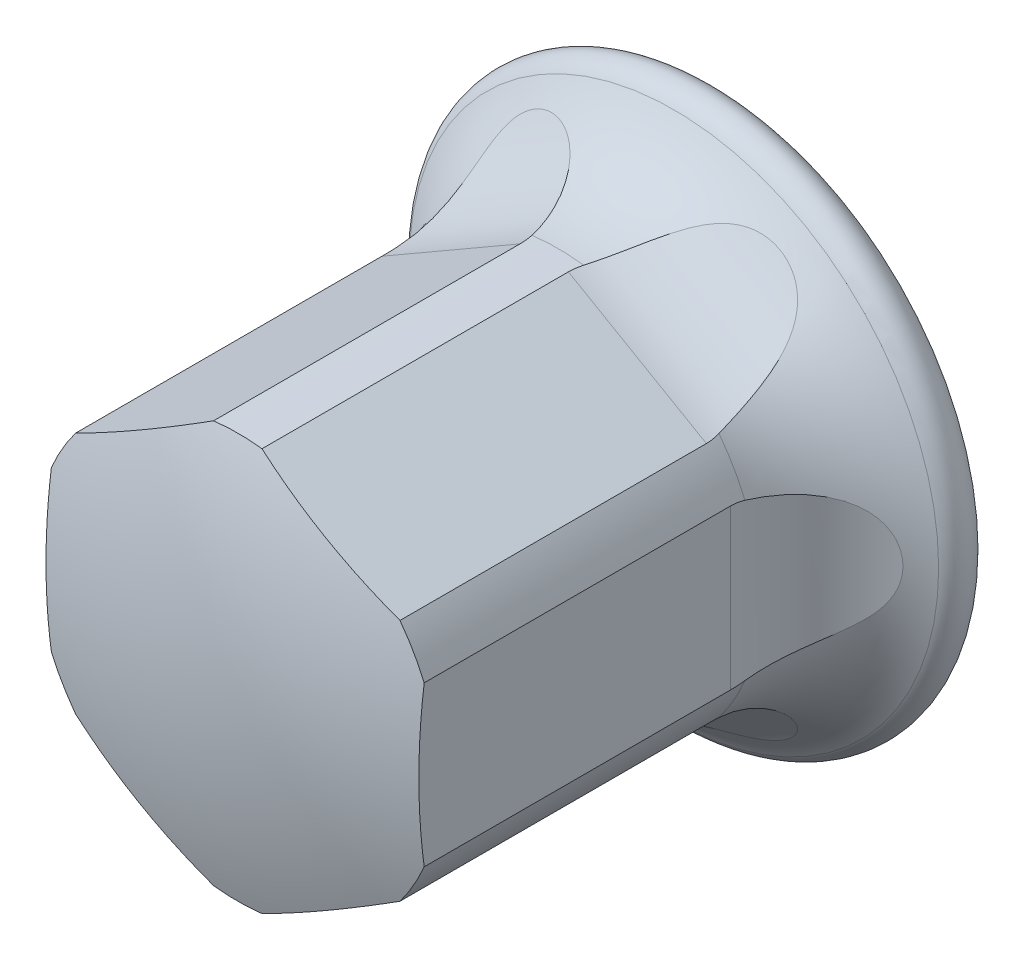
ISO-10303-21;
HEADER;
FILE_DESCRIPTION(('STEP AP214'),'2;1');
FILE_NAME('part.step','',(''),(''),'','','');
FILE_SCHEMA(('AUTOMOTIVE_DESIGN { 1 0 10303 214 1 1 1 1 }'));
ENDSEC;
DATA;
#1=APPLICATION_CONTEXT('core data for automotive mechanical design processes');
#2=APPLICATION_PROTOCOL_DEFINITION('international standard','automotive_design',2000,#1);
#3=PRODUCT_CONTEXT('',#1,'mechanical');
#4=PRODUCT('Part','Part','',(#3));
#5=PRODUCT_RELATED_PRODUCT_CATEGORY('part','',(#4));
#6=PRODUCT_DEFINITION_FORMATION('','',#4);
#7=PRODUCT_DEFINITION_CONTEXT('part definition',#1,'design');
#8=PRODUCT_DEFINITION('design','',#6,#7);
#9=PRODUCT_DEFINITION_SHAPE('','',#8);
#10=(LENGTH_UNIT() NAMED_UNIT(*) SI_UNIT(.MILLI.,.METRE.));
#11=(NAMED_UNIT(*) PLANE_ANGLE_UNIT() SI_UNIT($,.RADIAN.));
#12=(NAMED_UNIT(*) SI_UNIT($,.STERADIAN.) SOLID_ANGLE_UNIT());
#13=UNCERTAINTY_MEASURE_WITH_UNIT(LENGTH_MEASURE(1.E-05),#10,'distance_accuracy_value','');
#14=(GEOMETRIC_REPRESENTATION_CONTEXT(3) GLOBAL_UNCERTAINTY_ASSIGNED_CONTEXT((#13)) GLOBAL_UNIT_ASSIGNED_CONTEXT((#10,
#11,#12)) REPRESENTATION_CONTEXT('',''));
#15=CARTESIAN_POINT('',(0.,0.,0.));
#16=DIRECTION('',(0.,0.,1.));
#17=DIRECTION('',(1.,0.,0.));
#18=AXIS2_PLACEMENT_3D('',#15,#16,#17);
#19=CARTESIAN_POINT('',(0.,0.,0.));
#20=DIRECTION('',(0.,0.,1.));
#21=DIRECTION('',(1.,0.,0.));
#22=AXIS2_PLACEMENT_3D('',#19,#20,#21);
#23=CYLINDRICAL_SURFACE('',#22,4.35);
#24=DIRECTION('',(0.,0.,-1.));
#25=VECTOR('',#24,1.);
#26=CARTESIAN_POINT('',(0.519501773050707,4.31886766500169,13.7));
#27=LINE('',#26,#25);
#28=CARTESIAN_POINT('',(0.519501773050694,4.3188676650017,10.273998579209));
#29=VERTEX_POINT('',#28);
#30=CARTESIAN_POINT('',(0.519501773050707,4.31886766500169,3.7));
#31=VERTEX_POINT('',#30);
#32=EDGE_CURVE('E198',#29,#31,#27,.T.);
#33=ORIENTED_EDGE('',*,*,#32,.T.);
#34=CARTESIAN_POINT('',(3.4804982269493,2.60933556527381,3.7));
#35=CARTESIAN_POINT('',(3.48049682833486,2.60934010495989,3.7693719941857));
#36=CARTESIAN_POINT('',(3.47681641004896,2.61426906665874,3.83879710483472));
#37=CARTESIAN_POINT('',(3.46214629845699,2.63366352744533,3.97555350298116));
#38=CARTESIAN_POINT('',(3.45114780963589,2.64814050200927,4.04288216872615));
#39=CARTESIAN_POINT('',(3.42207462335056,2.68560240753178,4.17327151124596));
#40=CARTESIAN_POINT('',(3.40402157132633,2.70856130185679,4.23634455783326));
#41=CARTESIAN_POINT('',(3.36116907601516,2.7615571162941,4.35693510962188));
#42=CARTESIAN_POINT('',(3.3363700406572,2.79159360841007,4.41445295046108));
#43=CARTESIAN_POINT('',(3.27934010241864,2.85839592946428,4.52513251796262));
#44=CARTESIAN_POINT('',(3.24684960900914,2.89538445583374,4.57802467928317));
#45=CARTESIAN_POINT('',(3.17565309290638,2.97330015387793,4.67614009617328));
#46=CARTESIAN_POINT('',(3.13694463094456,3.01422886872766,4.72136032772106));
#47=CARTESIAN_POINT('',(3.04817208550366,3.10413662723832,4.80974445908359));
#48=CARTESIAN_POINT('',(2.99727709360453,3.15344174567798,4.85173948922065));
#49=CARTESIAN_POINT('',(2.88927022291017,3.25269286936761,4.92577189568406));
#50=CARTESIAN_POINT('',(2.8321544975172,3.30263925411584,4.95780306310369));
#51=CARTESIAN_POINT('',(2.70248645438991,3.40988032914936,5.01696034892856));
#52=CARTESIAN_POINT('',(2.62896243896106,3.46697625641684,5.04231950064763));
#53=CARTESIAN_POINT('',(2.47624853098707,3.57765439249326,5.08059039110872));
#54=CARTESIAN_POINT('',(2.39705521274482,3.63123443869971,5.09349453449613));
#55=CARTESIAN_POINT('',(2.22312729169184,3.74060989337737,5.1082026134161));
#56=CARTESIAN_POINT('',(2.12776899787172,3.79566547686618,5.1081998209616));
#57=CARTESIAN_POINT('',(1.93407396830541,3.89793132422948,5.09250399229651));
#58=CARTESIAN_POINT('',(1.8357347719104,3.94513488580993,5.0767976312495));
#59=CARTESIAN_POINT('',(1.63549427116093,4.03236996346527,5.02817352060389));
#60=CARTESIAN_POINT('',(1.53359571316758,4.07207172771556,4.99464080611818));
#61=CARTESIAN_POINT('',(1.33442874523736,4.14160198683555,4.90888707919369));
#62=CARTESIAN_POINT('',(1.2371518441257,4.17144923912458,4.85670196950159));
#63=CARTESIAN_POINT('',(1.07897327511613,4.21462531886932,4.75029659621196));
#64=CARTESIAN_POINT('',(1.01552825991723,4.23023909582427,4.70076367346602));
#65=CARTESIAN_POINT('',(0.896701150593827,4.25700890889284,4.59175667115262));
#66=CARTESIAN_POINT('',(0.841314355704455,4.26816755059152,4.53228843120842));
#67=CARTESIAN_POINT('',(0.741100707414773,4.28671192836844,4.40375378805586));
#68=CARTESIAN_POINT('',(0.696351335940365,4.29407041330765,4.33462245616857));
#69=CARTESIAN_POINT('',(0.620739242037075,4.30565472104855,4.18887476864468));
#70=CARTESIAN_POINT('',(0.589867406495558,4.30988260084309,4.11226336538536));
#71=CARTESIAN_POINT('',(0.546982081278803,4.31552065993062,3.96416078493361));
#72=CARTESIAN_POINT('',(0.533100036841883,4.31721598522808,3.89321865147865));
#73=CARTESIAN_POINT('',(0.518380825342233,4.31900934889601,3.74998343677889));
#74=CARTESIAN_POINT('',(0.517537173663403,4.31910818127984,3.67769104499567));
#75=CARTESIAN_POINT('',(0.528511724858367,4.3177768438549,3.53940630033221));
#76=CARTESIAN_POINT('',(0.539414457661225,4.31645723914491,3.47333782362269));
#77=CARTESIAN_POINT('',(0.571915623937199,4.31227067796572,3.34395556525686));
#78=CARTESIAN_POINT('',(0.593513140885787,4.30940385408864,3.28064154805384));
#79=CARTESIAN_POINT('',(0.646735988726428,4.30173904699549,3.15753883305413));
#80=CARTESIAN_POINT('',(0.678489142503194,4.29691622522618,3.09780727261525));
#81=CARTESIAN_POINT('',(0.750515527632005,4.28492190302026,2.98400581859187));
#82=CARTESIAN_POINT('',(0.790791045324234,4.27774977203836,2.92993745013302));
#83=CARTESIAN_POINT('',(0.882048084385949,4.25990932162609,2.82385552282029));
#84=CARTESIAN_POINT('',(0.933653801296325,4.24899256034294,2.77242266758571));
#85=CARTESIAN_POINT('',(1.0429791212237,4.22348773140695,2.67762469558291));
#86=CARTESIAN_POINT('',(1.10070167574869,4.20889788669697,2.63426350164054));
#87=CARTESIAN_POINT('',(1.22911737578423,4.17334658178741,2.54990840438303));
#88=CARTESIAN_POINT('',(1.30047319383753,4.15176552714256,2.51018680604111));
#89=CARTESIAN_POINT('',(1.44628818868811,4.10325124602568,2.44108273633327));
#90=CARTESIAN_POINT('',(1.52074922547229,4.07631477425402,2.41170656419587));
#91=CARTESIAN_POINT('',(1.6836161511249,4.01208598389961,2.35866161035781));
#92=CARTESIAN_POINT('',(1.77223238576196,3.97381077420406,2.33682354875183));
#93=CARTESIAN_POINT('',(1.94849386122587,3.89042448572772,2.30606578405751));
#94=CARTESIAN_POINT('',(2.0361384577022,3.84530913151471,2.29715419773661));
#95=CARTESIAN_POINT('',(2.21943297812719,3.74285697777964,2.29163525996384));
#96=CARTESIAN_POINT('',(2.31467938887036,3.68469537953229,2.29674097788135));
#97=CARTESIAN_POINT('',(2.49893265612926,3.56231359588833,2.32325066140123));
#98=CARTESIAN_POINT('',(2.58793462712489,3.49808875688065,2.34466723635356));
#99=CARTESIAN_POINT('',(2.75854643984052,3.36522985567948,2.40508052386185));
#100=CARTESIAN_POINT('',(2.84002778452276,3.29654470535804,2.44433205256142));
#101=CARTESIAN_POINT('',(2.99142451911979,3.15978275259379,2.5416013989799));
#102=CARTESIAN_POINT('',(3.06136599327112,3.09170491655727,2.59957599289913));
#103=CARTESIAN_POINT('',(3.16834822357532,2.98129686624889,2.7144706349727));
#104=CARTESIAN_POINT('',(3.20897461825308,2.93735239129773,2.76652738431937));
#105=CARTESIAN_POINT('',(3.28249616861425,2.85495345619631,2.87973982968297));
#106=CARTESIAN_POINT('',(3.31539373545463,2.81649728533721,2.94089267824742));
#107=CARTESIAN_POINT('',(3.372887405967,2.7473948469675,3.07169703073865));
#108=CARTESIAN_POINT('',(3.3974241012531,2.716804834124,3.14140475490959));
#109=CARTESIAN_POINT('',(3.43725485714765,2.66623923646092,3.28697936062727));
#110=CARTESIAN_POINT('',(3.45256690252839,2.6462430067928,3.36283392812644));
#111=CARTESIAN_POINT('',(3.46889309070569,2.62475959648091,3.48293364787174));
#112=CARTESIAN_POINT('',(3.47324088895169,2.61899229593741,3.52602166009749));
#113=CARTESIAN_POINT('',(3.47904380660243,2.61127897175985,3.61273279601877));
#114=CARTESIAN_POINT('',(3.48049910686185,2.60933270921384,3.6563558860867));
#115=CARTESIAN_POINT('',(3.4804982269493,2.60933556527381,3.7));
#116=B_SPLINE_CURVE_WITH_KNOTS('',3,(#34,#35,#36,#37,#38,#39,#40,#41,#42,#43,#44,#45,#46,#47,
#48,#49,#50,#51,#52,#53,#54,#55,#56,#57,#58,#59,#60,#61,#62,#63,#64,#65,#66,#67,#68,#69,#70,#71,
#72,#73,#74,#75,#76,#77,#78,#79,#80,#81,#82,#83,#84,#85,#86,#87,#88,#89,#90,#91,#92,#93,#94,#95,
#96,#97,#98,#99,#100,#101,#102,#103,#104,#105,#106,#107,#108,#109,#110,#111,#112,#113,#114,
#115),.UNSPECIFIED.,.T.,.F.,(4,2,2,2,2,2,2,2,2,2,2,2,2,2,2,2,2,2,2,2,2,2,2,2,2,2,2,2,2,2,2,2,2,
2,2,2,2,2,2,2,4),(0.,0.207941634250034,0.416133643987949,0.623691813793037,0.831237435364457,
1.04716098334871,1.26316944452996,1.5093407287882,1.75566510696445,2.0439800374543,
2.3324706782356,2.66134564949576,2.99049991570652,3.33182561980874,3.67249783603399,
3.91749685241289,4.16235237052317,4.40894019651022,4.65536585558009,4.87112890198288,
5.08678463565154,5.28677230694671,5.48674284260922,5.68933647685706,5.89198453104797,
6.11213337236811,6.33238892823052,6.58483685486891,6.83743822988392,7.13316654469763,
7.42908047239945,7.76271145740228,8.09660062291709,8.43541797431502,8.77345866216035,
9.01046922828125,9.2474057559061,9.48599235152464,9.72411227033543,9.85494310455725,
9.98576575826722),.UNSPECIFIED.);
#117=CARTESIAN_POINT('',(0.556003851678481,4.31432030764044,3.40730115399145));
#118=VERTEX_POINT('',#117);
#119=EDGE_CURVE('E329',#31,#118,#116,.T.);
#120=ORIENTED_EDGE('',*,*,#119,.T.);
#121=CARTESIAN_POINT('',(0.,0.,3.40730115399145));
#122=DIRECTION('',(0.,0.,1.));
#123=DIRECTION('',(1.,0.,0.));
#124=AXIS2_PLACEMENT_3D('',#121,#122,#123);
#125=CIRCLE('',#124,4.35);
#126=CARTESIAN_POINT('',(-0.556003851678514,4.31432030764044,3.40730115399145));
#127=VERTEX_POINT('',#126);
#128=EDGE_CURVE('E302',#127,#118,#125,.F.);
#129=ORIENTED_EDGE('',*,*,#128,.F.);
#130=CARTESIAN_POINT('',(-0.519501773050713,4.3188676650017,3.7));
#131=CARTESIAN_POINT('',(-0.519506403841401,4.3188687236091,3.7693719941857));
#132=CARTESIAN_POINT('',(-0.525615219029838,4.31814586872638,3.83879710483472));
#133=CARTESIAN_POINT('',(-0.549746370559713,4.31513840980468,3.97555350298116));
#134=CARTESIAN_POINT('',(-0.567783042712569,4.31285192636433,4.04288216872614));
#135=CARTESIAN_POINT('',(-0.614762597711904,4.30640476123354,4.17327151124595));
#136=CARTESIAN_POINT('',(-0.643672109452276,4.30224980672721,4.23634455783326));
#137=CARTESIAN_POINT('',(-0.710994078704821,4.29163636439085,4.35693510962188));
#138=CARTESIAN_POINT('',(-0.749405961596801,4.28517801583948,4.41445295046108));
#139=CARTESIAN_POINT('',(-0.835773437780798,4.26918980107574,4.52513251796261));
#140=CARTESIAN_POINT('',(-0.884051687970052,4.25954647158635,4.57802467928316));
#141=CARTESIAN_POINT('',(-0.987126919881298,4.23684632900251,4.67614009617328));
#142=CARTESIAN_POINT('',(-1.04192645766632,4.22378817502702,4.72136032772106));
#143=CARTESIAN_POINT('',(-1.16417513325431,4.19186277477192,4.80974445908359));
#144=CARTESIAN_POINT('',(-1.23232211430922,4.1724389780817,4.85173948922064));
#145=CARTESIAN_POINT('',(-1.37227954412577,4.12852784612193,4.92577189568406));
#146=CARTESIAN_POINT('',(-1.44409224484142,4.10403736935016,4.95780306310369));
#147=CARTESIAN_POINT('',(-1.60179976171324,4.04536208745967,5.01696034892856));
#148=CARTESIAN_POINT('',(-1.68800829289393,4.01023638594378,5.04231950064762));
#149=CARTESIAN_POINT('',(-1.86021532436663,3.93332133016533,5.08059039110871));
#150=CARTESIAN_POINT('',(-1.94621366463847,3.89152792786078,5.09349453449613));
#151=CARTESIAN_POINT('',(-2.12789954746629,3.79558965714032,5.1082026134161));
#152=CARTESIAN_POINT('',(-2.22325822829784,3.74053474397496,5.10819982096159));
#153=CARTESIAN_POINT('',(-2.40867056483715,3.6239228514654,5.0925039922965));
#154=CARTESIAN_POINT('',(-2.49871964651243,3.5623603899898,5.07679763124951));
#155=CARTESIAN_POINT('',(-2.6743876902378,3.43256456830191,5.02817352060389));
#156=CARTESIAN_POINT('',(-2.75971970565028,3.36416871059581,4.99464080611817));
#157=CARTESIAN_POINT('',(-2.91951816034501,3.22645018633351,4.90888707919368));
#158=CARTESIAN_POINT('',(-2.99400508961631,3.15712954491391,4.85670196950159));
#159=CARTESIAN_POINT('',(-3.11048595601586,3.04173092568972,4.75029659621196));
#160=CARTESIAN_POINT('',(-3.15573039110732,2.99459281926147,4.700763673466));
#161=CARTESIAN_POINT('',(-3.23832728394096,2.90507043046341,4.59175667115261));
#162=CARTESIAN_POINT('',(-3.27568434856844,2.86268337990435,4.53228843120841));
#163=CARTESIAN_POINT('',(-3.34185107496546,2.78516800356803,4.40375378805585));
#164=CARTESIAN_POINT('',(-3.37059839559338,2.75009315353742,4.33462245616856));
#165=CARTESIAN_POINT('',(-3.4184367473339,2.69040331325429,4.18887476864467));
#166=CARTESIAN_POINT('',(-3.43753411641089,2.66578145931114,4.11226336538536));
#167=CARTESIAN_POINT('',(-3.46385948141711,2.63146070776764,3.96416078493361));
#168=CARTESIAN_POINT('',(-3.47226869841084,2.62028616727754,3.89321865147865));
#169=CARTESIAN_POINT('',(-3.48118140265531,2.60843563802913,3.74998343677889));
#170=CARTESIAN_POINT('',(-3.48168881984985,2.60775443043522,3.67769104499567));
#171=CARTESIAN_POINT('',(-3.47504857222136,2.61659300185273,3.53940630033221));
#172=CARTESIAN_POINT('',(-3.46845439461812,2.62537524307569,3.47333782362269));
#173=CARTESIAN_POINT('',(-3.44857814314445,2.65142879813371,3.34395556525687));
#174=CARTESIAN_POINT('',(-3.43529664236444,2.6686993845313,3.28064154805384));
#175=CARTESIAN_POINT('',(-3.40204730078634,2.71095931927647,3.15753883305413));
#176=CARTESIAN_POINT('',(-3.38199403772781,2.73604694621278,3.09780727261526));
#177=CARTESIAN_POINT('',(-3.3355934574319,2.79242646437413,2.98400581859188));
#178=CARTESIAN_POINT('',(-3.3092444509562,2.82372002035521,2.92993745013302));
#179=CARTESIAN_POINT('',(-3.24816564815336,2.89383070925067,2.82385552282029));
#180=CARTESIAN_POINT('',(-3.21290859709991,2.933064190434,2.77242266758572));
#181=CARTESIAN_POINT('',(-3.13615810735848,3.01499028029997,2.67762469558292));
#182=CARTESIAN_POINT('',(-3.09466165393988,3.05768455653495,2.63426350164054));
#183=CARTESIAN_POINT('',(-2.99966547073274,3.1511201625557,2.54990840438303));
#184=CARTESIAN_POINT('',(-2.94529782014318,3.20212558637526,2.51018680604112));
#185=CARTESIAN_POINT('',(-2.83037572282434,3.30414793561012,2.44108273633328));
#186=CARTESIAN_POINT('',(-2.76981753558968,3.35516484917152,2.41170656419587));
#187=CARTESIAN_POINT('',(-2.63276030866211,3.46409734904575,2.35866161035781));
#188=CARTESIAN_POINT('',(-2.55530488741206,3.52170365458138,2.33682354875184));
#189=CARTESIAN_POINT('',(-2.39495950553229,3.63265742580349,2.30606578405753));
#190=CARTESIAN_POINT('',(-2.31206616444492,3.68600219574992,2.29715419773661));
#191=CARTESIAN_POINT('',(-2.13169273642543,3.79351382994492,2.29163525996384));
#192=CARTESIAN_POINT('',(-2.03370010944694,3.84691884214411,2.29674097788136));
#193=CARTESIAN_POINT('',(-1.83558774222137,3.94529596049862,2.32325066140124));
#194=CARTESIAN_POINT('',(-1.73546641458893,3.99026150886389,2.34466723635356));
#195=CARTESIAN_POINT('',(-1.53510132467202,4.07158622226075,2.40508052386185));
#196=CARTESIAN_POINT('',(-1.43487756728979,4.10780856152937,2.44433205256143));
#197=CARTESIAN_POINT('',(-1.24073987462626,4.17054100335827,2.54160139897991));
#198=CARTESIAN_POINT('',(-1.1468120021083,4.1970731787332,2.59957599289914));
#199=CARTESIAN_POINT('',(-0.997704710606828,4.23451848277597,2.7144706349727));
#200=CARTESIAN_POINT('',(-0.93933448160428,4.2477297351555,2.76652738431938));
#201=CARTESIAN_POINT('',(-0.831214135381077,4.27020179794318,2.87973982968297));
#202=CARTESIAN_POINT('',(-0.781461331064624,4.2794638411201,2.94089267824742));
#203=CARTESIAN_POINT('',(-0.692870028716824,4.29470360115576,3.07169703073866));
#204=CARTESIAN_POINT('',(-0.65410995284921,4.3006579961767,3.14140475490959));
#205=CARTESIAN_POINT('',(-0.590403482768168,4.30986964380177,3.28697936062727));
#206=CARTESIAN_POINT('',(-0.565430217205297,4.31313214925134,3.36283392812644));
#207=CARTESIAN_POINT('',(-0.538661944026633,4.31652933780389,3.48293364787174));
#208=CARTESIAN_POINT('',(-0.531493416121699,4.31741099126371,3.5260216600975));
#209=CARTESIAN_POINT('',(-0.52191202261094,4.31857980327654,3.61273279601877));
#210=CARTESIAN_POINT('',(-0.519498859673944,4.31886699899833,3.6563558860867));
#211=CARTESIAN_POINT('',(-0.519501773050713,4.3188676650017,3.7));
#212=B_SPLINE_CURVE_WITH_KNOTS('',3,(#130,#131,#132,#133,#134,#135,#136,#137,#138,#139,#140,
#141,#142,#143,#144,#145,#146,#147,#148,#149,#150,#151,#152,#153,#154,#155,#156,#157,#158,#159,
#160,#161,#162,#163,#164,#165,#166,#167,#168,#169,#170,#171,#172,#173,#174,#175,#176,#177,#178,
#179,#180,#181,#182,#183,#184,#185,#186,#187,#188,#189,#190,#191,#192,#193,#194,#195,#196,#197,
#198,#199,#200,#201,#202,#203,#204,#205,#206,#207,#208,#209,#210,#211),.UNSPECIFIED.,.T.,.F.,(4,
2,2,2,2,2,2,2,2,2,2,2,2,2,2,2,2,2,2,2,2,2,2,2,2,2,2,2,2,2,2,2,2,2,2,2,2,2,2,2,4),(0.,
0.207941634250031,0.416133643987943,0.623691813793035,0.831237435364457,1.04716098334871,
1.26316944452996,1.5093407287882,1.75566510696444,2.0439800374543,2.33247067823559,
2.66134564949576,2.99049991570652,3.33182561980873,3.67249783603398,3.91749685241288,
4.16235237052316,4.4089401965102,4.65536585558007,4.87112890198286,5.08678463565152,
5.28677230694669,5.4867428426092,5.68933647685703,5.89198453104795,6.11213337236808,
6.33238892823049,6.58483685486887,6.83743822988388,7.1331665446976,7.42908047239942,
7.76271145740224,8.09660062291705,8.43541797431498,8.77345866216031,9.01046922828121,
9.24740575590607,9.4859923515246,9.72411227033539,9.85494310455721,9.98576575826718),.UNSPECIFIED.);
#213=CARTESIAN_POINT('',(-0.519501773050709,4.3188676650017,3.7));
#214=VERTEX_POINT('',#213);
#215=EDGE_CURVE('E378',#127,#214,#212,.T.);
#216=ORIENTED_EDGE('',*,*,#215,.T.);
#217=DIRECTION('',(0.,0.,-1.));
#218=VECTOR('',#217,1.);
#219=CARTESIAN_POINT('',(-0.519501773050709,4.31886766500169,13.7));
#220=LINE('',#219,#218);
#221=CARTESIAN_POINT('',(-0.519501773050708,4.31886766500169,10.273998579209));
#222=VERTEX_POINT('',#221);
#223=EDGE_CURVE('E192',#222,#214,#220,.T.);
#224=ORIENTED_EDGE('',*,*,#223,.F.);
#225=CARTESIAN_POINT('',(0.,0.,10.273998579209));
#226=DIRECTION('',(0.,0.,1.));
#227=DIRECTION('',(1.,0.,0.));
#228=AXIS2_PLACEMENT_3D('',#225,#226,#227);
#229=CIRCLE('',#228,4.35);
#230=EDGE_CURVE('E225',#29,#222,#229,.T.);
#231=ORIENTED_EDGE('',*,*,#230,.F.);
#232=EDGE_LOOP('',(#33,#120,#129,#216,#224,#231));
#233=FACE_BOUND('',#232,.T.);
#234=ADVANCED_FACE('F16',(#233),#23,.T.);
#235=DIRECTION('',(0.,0.,-1.));
#236=VECTOR('',#235,1.);
#237=CARTESIAN_POINT('',(3.48049822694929,-2.60933556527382,13.7));
#238=LINE('',#237,#236);
#239=CARTESIAN_POINT('',(3.48049822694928,-2.60933556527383,10.273998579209));
#240=VERTEX_POINT('',#239);
#241=CARTESIAN_POINT('',(3.48049822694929,-2.60933556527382,3.7));
#242=VERTEX_POINT('',#241);
#243=EDGE_CURVE('E32',#240,#242,#238,.T.);
#244=ORIENTED_EDGE('',*,*,#243,.T.);
#245=CARTESIAN_POINT('',(0.51950177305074,-4.31886766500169,3.7));
#246=CARTESIAN_POINT('',(0.519506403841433,-4.31886872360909,3.76937199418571));
#247=CARTESIAN_POINT('',(0.525615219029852,-4.31814586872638,3.83879710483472));
#248=CARTESIAN_POINT('',(0.549746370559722,-4.31513840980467,3.97555350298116));
#249=CARTESIAN_POINT('',(0.567783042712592,-4.31285192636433,4.04288216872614));
#250=CARTESIAN_POINT('',(0.61476259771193,-4.30640476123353,4.17327151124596));
#251=CARTESIAN_POINT('',(0.64367210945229,-4.30224980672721,4.23634455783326));
#252=CARTESIAN_POINT('',(0.710994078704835,-4.29163636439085,4.35693510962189));
#253=CARTESIAN_POINT('',(0.749405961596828,-4.28517801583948,4.41445295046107));
#254=CARTESIAN_POINT('',(0.835773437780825,-4.26918980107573,4.52513251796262));
#255=CARTESIAN_POINT('',(0.884051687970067,-4.25954647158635,4.57802467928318));
#256=CARTESIAN_POINT('',(0.987126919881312,-4.23684632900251,4.67614009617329));
#257=CARTESIAN_POINT('',(1.04192645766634,-4.22378817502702,4.72136032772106));
#258=CARTESIAN_POINT('',(1.16417513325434,-4.19186277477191,4.80974445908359));
#259=CARTESIAN_POINT('',(1.23232211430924,-4.17243897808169,4.85173948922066));
#260=CARTESIAN_POINT('',(1.37227954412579,-4.12852784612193,4.92577189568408));
#261=CARTESIAN_POINT('',(1.44409224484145,-4.10403736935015,4.95780306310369));
#262=CARTESIAN_POINT('',(1.60179976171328,-4.04536208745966,5.01696034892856));
#263=CARTESIAN_POINT('',(1.68800829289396,-4.01023638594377,5.04231950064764));
#264=CARTESIAN_POINT('',(1.86021532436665,-3.93332133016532,5.08059039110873));
#265=CARTESIAN_POINT('',(1.9462136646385,-3.89152792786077,5.09349453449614));
#266=CARTESIAN_POINT('',(2.12789954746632,-3.7955896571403,5.10820261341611));
#267=CARTESIAN_POINT('',(2.22325822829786,-3.74053474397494,5.10819982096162));
#268=CARTESIAN_POINT('',(2.40867056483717,-3.62392285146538,5.09250399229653));
#269=CARTESIAN_POINT('',(2.49871964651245,-3.56236038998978,5.0767976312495));
#270=CARTESIAN_POINT('',(2.67438769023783,-3.43256456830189,5.0281735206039));
#271=CARTESIAN_POINT('',(2.75971970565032,-3.36416871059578,4.9946408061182));
#272=CARTESIAN_POINT('',(2.91951816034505,-3.22645018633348,4.9088870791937));
#273=CARTESIAN_POINT('',(2.99400508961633,-3.15712954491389,4.85670196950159));
#274=CARTESIAN_POINT('',(3.11048595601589,-3.04173092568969,4.75029659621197));
#275=CARTESIAN_POINT('',(3.15573039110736,-2.99459281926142,4.70076367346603));
#276=CARTESIAN_POINT('',(3.23832728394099,-2.90507043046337,4.59175667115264));
#277=CARTESIAN_POINT('',(3.27568434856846,-2.86268337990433,4.53228843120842));
#278=CARTESIAN_POINT('',(3.34185107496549,-2.785168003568,4.40375378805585));
#279=CARTESIAN_POINT('',(3.37059839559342,-2.75009315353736,4.33462245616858));
#280=CARTESIAN_POINT('',(3.41843674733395,-2.69040331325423,4.18887476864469));
#281=CARTESIAN_POINT('',(3.43753411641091,-2.66578145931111,4.11226336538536));
#282=CARTESIAN_POINT('',(3.46385948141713,-2.63146070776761,3.96416078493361));
#283=CARTESIAN_POINT('',(3.47226869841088,-2.62028616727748,3.89321865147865));
#284=CARTESIAN_POINT('',(3.48118140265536,-2.60843563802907,3.74998343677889));
#285=CARTESIAN_POINT('',(3.48168881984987,-2.6077544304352,3.67769104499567));
#286=CARTESIAN_POINT('',(3.47504857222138,-2.6165930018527,3.5394063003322));
#287=CARTESIAN_POINT('',(3.46845439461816,-2.62537524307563,3.47333782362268));
#288=CARTESIAN_POINT('',(3.4485781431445,-2.65142879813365,3.34395556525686));
#289=CARTESIAN_POINT('',(3.43529664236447,-2.66869938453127,3.28064154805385));
#290=CARTESIAN_POINT('',(3.40204730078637,-2.71095931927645,3.15753883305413));
#291=CARTESIAN_POINT('',(3.38199403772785,-2.73604694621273,3.09780727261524));
#292=CARTESIAN_POINT('',(3.33559345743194,-2.79242646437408,2.98400581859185));
#293=CARTESIAN_POINT('',(3.30924445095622,-2.82372002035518,2.92993745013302));
#294=CARTESIAN_POINT('',(3.24816564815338,-2.89383070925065,2.82385552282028));
#295=CARTESIAN_POINT('',(3.21290859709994,-2.93306419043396,2.77242266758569));
#296=CARTESIAN_POINT('',(3.13615810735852,-3.01499028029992,2.67762469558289));
#297=CARTESIAN_POINT('',(3.09466165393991,-3.05768455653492,2.63426350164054));
#298=CARTESIAN_POINT('',(2.99966547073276,-3.15112016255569,2.54990840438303));
#299=CARTESIAN_POINT('',(2.94529782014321,-3.20212558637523,2.51018680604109));
#300=CARTESIAN_POINT('',(2.83037572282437,-3.30414793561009,2.44108273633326));
#301=CARTESIAN_POINT('',(2.7698175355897,-3.3551648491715,2.41170656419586));
#302=CARTESIAN_POINT('',(2.63276030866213,-3.46409734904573,2.35866161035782));
#303=CARTESIAN_POINT('',(2.55530488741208,-3.52170365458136,2.33682354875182));
#304=CARTESIAN_POINT('',(2.39495950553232,-3.63265742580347,2.3060657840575));
#305=CARTESIAN_POINT('',(2.31206616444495,-3.6860021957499,2.29715419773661));
#306=CARTESIAN_POINT('',(2.13169273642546,-3.7935138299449,2.29163525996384));
#307=CARTESIAN_POINT('',(2.03370010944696,-3.84691884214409,2.29674097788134));
#308=CARTESIAN_POINT('',(1.83558774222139,-3.9452959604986,2.32325066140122));
#309=CARTESIAN_POINT('',(1.73546641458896,-3.99026150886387,2.34466723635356));
#310=CARTESIAN_POINT('',(1.53510132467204,-4.07158622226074,2.40508052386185));
#311=CARTESIAN_POINT('',(1.4348775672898,-4.10780856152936,2.44433205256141));
#312=CARTESIAN_POINT('',(1.24073987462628,-4.17054100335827,2.54160139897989));
#313=CARTESIAN_POINT('',(1.14681200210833,-4.19707317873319,2.59957599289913));
#314=CARTESIAN_POINT('',(0.997704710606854,-4.23451848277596,2.7144706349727));
#315=CARTESIAN_POINT('',(0.939334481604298,-4.2477297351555,2.76652738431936));
#316=CARTESIAN_POINT('',(0.831214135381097,-4.27020179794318,2.87973982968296));
#317=CARTESIAN_POINT('',(0.781461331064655,-4.27946384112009,2.94089267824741));
#318=CARTESIAN_POINT('',(0.692870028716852,-4.29470360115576,3.07169703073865));
#319=CARTESIAN_POINT('',(0.654109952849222,-4.3006579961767,3.14140475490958));
#320=CARTESIAN_POINT('',(0.590403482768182,-4.30986964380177,3.28697936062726));
#321=CARTESIAN_POINT('',(0.565430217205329,-4.31313214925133,3.36283392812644));
#322=CARTESIAN_POINT('',(0.538661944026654,-4.31652933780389,3.48293364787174));
#323=CARTESIAN_POINT('',(0.531493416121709,-4.31741099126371,3.52602166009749));
#324=CARTESIAN_POINT('',(0.521912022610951,-4.31857980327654,3.61273279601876));
#325=CARTESIAN_POINT('',(0.519498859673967,-4.31886699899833,3.6563558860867));
#326=CARTESIAN_POINT('',(0.51950177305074,-4.31886766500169,3.7));
#327=B_SPLINE_CURVE_WITH_KNOTS('',3,(#245,#246,#247,#248,#249,#250,#251,#252,#253,#254,#255,
#256,#257,#258,#259,#260,#261,#262,#263,#264,#265,#266,#267,#268,#269,#270,#271,#272,#273,#274,
#275,#276,#277,#278,#279,#280,#281,#282,#283,#284,#285,#286,#287,#288,#289,#290,#291,#292,#293,
#294,#295,#296,#297,#298,#299,#300,#301,#302,#303,#304,#305,#306,#307,#308,#309,#310,#311,#312,
#313,#314,#315,#316,#317,#318,#319,#320,#321,#322,#323,#324,#325,#326),.UNSPECIFIED.,.T.,.F.,(4,
2,2,2,2,2,2,2,2,2,2,2,2,2,2,2,2,2,2,2,2,2,2,2,2,2,2,2,2,2,2,2,2,2,2,2,2,2,2,2,4),(0.,
0.207941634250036,0.41613364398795,0.623691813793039,0.831237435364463,1.04716098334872,
1.26316944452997,1.50934072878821,1.75566510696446,2.04398003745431,2.33247067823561,
2.66134564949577,2.99049991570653,3.33182561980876,3.67249783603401,3.91749685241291,
4.16235237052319,4.40894019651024,4.65536585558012,4.87112890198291,5.08678463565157,
5.28677230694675,5.48674284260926,5.6893364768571,5.89198453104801,6.11213337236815,
6.33238892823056,6.58483685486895,6.83743822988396,7.13316654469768,7.42908047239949,
7.76271145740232,8.09660062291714,8.43541797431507,8.7734586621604,9.0104692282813,
9.24740575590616,9.48599235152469,9.72411227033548,9.8549431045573,9.98576575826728),.UNSPECIFIED.);
#328=CARTESIAN_POINT('',(3.4583090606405,-2.63867361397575,3.40730115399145));
#329=VERTEX_POINT('',#328);
#330=EDGE_CURVE('E148',#242,#329,#327,.T.);
#331=ORIENTED_EDGE('',*,*,#330,.T.);
#332=CARTESIAN_POINT('',(4.01431291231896,-1.67564669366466,3.40730115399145));
#333=VERTEX_POINT('',#332);
#334=EDGE_CURVE('E227',#333,#329,#125,.F.);
#335=ORIENTED_EDGE('',*,*,#334,.F.);
#336=CARTESIAN_POINT('',(4.01431291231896,-1.67564669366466,3.40730115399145));
#337=CARTESIAN_POINT('',(4.0111115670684,-1.68331109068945,3.43993235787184));
#338=CARTESIAN_POINT('',(4.00842288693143,-1.68969629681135,3.47289959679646));
#339=CARTESIAN_POINT('',(4.00412252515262,-1.69986356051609,3.53930205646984));
#340=CARTESIAN_POINT('',(4.00251084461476,-1.70364561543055,3.57273727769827));
#341=CARTESIAN_POINT('',(3.99937510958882,-1.71100510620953,3.67323688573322));
#342=CARTESIAN_POINT('',(3.9995305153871,-1.7106424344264,3.7406938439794));
#343=CARTESIAN_POINT('',(4.00433213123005,-1.6993696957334,3.87456612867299));
#344=CARTESIAN_POINT('',(4.00898155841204,-1.68845207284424,3.94098067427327));
#345=CARTESIAN_POINT('',(4.02229852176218,-1.65647547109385,4.07088738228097));
#346=CARTESIAN_POINT('',(4.03096583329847,-1.63541705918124,4.13437970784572));
#347=CARTESIAN_POINT('',(4.05155788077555,-1.58371486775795,4.25732323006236));
#348=CARTESIAN_POINT('',(4.06350700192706,-1.55299907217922,4.31673983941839));
#349=CARTESIAN_POINT('',(4.08954626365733,-1.48307115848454,4.42981646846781));
#350=CARTESIAN_POINT('',(4.10363730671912,-1.4438554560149,4.48347404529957));
#351=CARTESIAN_POINT('',(4.13410500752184,-1.35428975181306,4.58877267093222));
#352=CARTESIAN_POINT('',(4.15057339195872,-1.30325800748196,4.63980526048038));
#353=CARTESIAN_POINT('',(4.18327617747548,-1.19413090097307,4.7337041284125));
#354=CARTESIAN_POINT('',(4.19951047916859,-1.13603263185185,4.77656702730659));
#355=CARTESIAN_POINT('',(4.2328649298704,-1.00525862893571,4.85985792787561));
#356=CARTESIAN_POINT('',(4.24976011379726,-0.931698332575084,4.89898486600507));
#357=CARTESIAN_POINT('',(4.28033268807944,-0.779300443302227,4.96680410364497));
#358=CARTESIAN_POINT('',(4.29400800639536,-0.700459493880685,4.99548969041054));
#359=CARTESIAN_POINT('',(4.31919173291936,-0.525500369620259,5.04693470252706));
#360=CARTESIAN_POINT('',(4.32993342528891,-0.428727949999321,5.06785048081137));
#361=CARTESIAN_POINT('',(4.34488261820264,-0.232760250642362,5.09664148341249));
#362=CARTESIAN_POINT('',(4.34908608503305,-0.133563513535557,5.10450865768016));
#363=CARTESIAN_POINT('',(4.35074126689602,0.0774317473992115,5.10763879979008));
#364=CARTESIAN_POINT('',(4.34729108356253,0.189267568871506,5.10121778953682));
#365=CARTESIAN_POINT('',(4.33202497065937,0.410292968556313,5.07192525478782));
#366=CARTESIAN_POINT('',(4.32020272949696,0.519480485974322,5.04904131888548));
#367=CARTESIAN_POINT('',(4.28921403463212,0.732695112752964,4.98565270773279));
#368=CARTESIAN_POINT('',(4.26998230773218,0.83666680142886,4.94499097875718));
#369=CARTESIAN_POINT('',(4.2265325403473,1.03395759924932,4.84491514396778));
#370=CARTESIAN_POINT('',(4.20232623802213,1.12730099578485,4.78554501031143));
#371=CARTESIAN_POINT('',(4.16022123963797,1.27238316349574,4.66863026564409));
#372=CARTESIAN_POINT('',(4.14262945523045,1.32816594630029,4.61596590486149));
#373=CARTESIAN_POINT('',(4.108511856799,1.43021529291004,4.50177208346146));
#374=CARTESIAN_POINT('',(4.09198537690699,1.47648784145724,4.44024823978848));
#375=CARTESIAN_POINT('',(4.06169374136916,1.55790123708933,4.30902274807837));
#376=CARTESIAN_POINT('',(4.04794599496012,1.59297265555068,4.23927362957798));
#377=CARTESIAN_POINT('',(4.02505689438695,1.64996187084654,4.09384225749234));
#378=CARTESIAN_POINT('',(4.01591456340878,1.67188245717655,4.01816126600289));
#379=CARTESIAN_POINT('',(4.00414134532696,1.69986885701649,3.8720804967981));
#380=CARTESIAN_POINT('',(4.00090838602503,1.70740471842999,3.80200658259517));
#381=CARTESIAN_POINT('',(3.99942856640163,1.71087096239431,3.66158109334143));
#382=CARTESIAN_POINT('',(4.00117255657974,1.7068226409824,3.59123026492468));
#383=CARTESIAN_POINT('',(4.00643602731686,1.69439520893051,3.50263022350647));
#384=CARTESIAN_POINT('',(4.00776689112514,1.69124756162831,3.48340874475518));
#385=CARTESIAN_POINT('',(4.01078008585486,1.68409010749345,3.44518936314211));
#386=CARTESIAN_POINT('',(4.01246180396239,1.6800818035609,3.42619113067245));
#387=CARTESIAN_POINT('',(4.01431291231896,1.67564669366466,3.40730115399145));
#388=B_SPLINE_CURVE_WITH_KNOTS('',3,(#336,#337,#338,#339,#340,#341,#342,#343,#344,#345,#346,
#347,#348,#349,#350,#351,#352,#353,#354,#355,#356,#357,#358,#359,#360,#361,#362,#363,#364,#365,
#366,#367,#368,#369,#370,#371,#372,#373,#374,#375,#376,#377,#378,#379,#380,#381,#382,#383,#384,
#385,#386,#387),.UNSPECIFIED.,.F.,.F.,(4,2,2,2,2,2,2,2,2,2,2,2,2,2,2,2,2,2,2,2,2,2,2,2,2,4),(0.,
0.100955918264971,0.201911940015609,0.40321706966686,0.604666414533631,0.806104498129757,
1.00908185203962,1.21214496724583,1.43335022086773,1.65464678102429,1.90872200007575,
2.16296027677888,2.46053548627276,2.75829421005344,3.0929768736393,3.42791211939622,
3.76586802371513,4.10303544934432,4.33821237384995,4.57324084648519,4.80969904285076,
5.0461070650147,5.25669715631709,5.46690035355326,5.52545443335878,5.58390708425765),.UNSPECIFIED.);
#389=CARTESIAN_POINT('',(4.,-1.70953209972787,3.7));
#390=VERTEX_POINT('',#389);
#391=EDGE_CURVE('E463',#333,#390,#388,.T.);
#392=ORIENTED_EDGE('',*,*,#391,.T.);
#393=DIRECTION('',(0.,0.,-1.));
#394=VECTOR('',#393,1.);
#395=CARTESIAN_POINT('',(4.,-1.70953209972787,13.7));
#396=LINE('',#395,#394);
#397=CARTESIAN_POINT('',(4.,-1.70953209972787,10.273998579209));
#398=VERTEX_POINT('',#397);
#399=EDGE_CURVE('E452',#398,#390,#396,.T.);
#400=ORIENTED_EDGE('',*,*,#399,.F.);
#401=EDGE_CURVE('E226',#240,#398,#229,.T.);
#402=ORIENTED_EDGE('',*,*,#401,.F.);
#403=EDGE_LOOP('',(#244,#331,#335,#392,#400,#402));
#404=FACE_BOUND('',#403,.T.);
#405=ADVANCED_FACE('F268',(#404),#23,.T.);
#406=CARTESIAN_POINT('',(0.55600385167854,-4.31432030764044,3.40730115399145));
#407=VERTEX_POINT('',#406);
#408=CARTESIAN_POINT('',(-0.556003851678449,-4.31432030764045,3.40730115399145));
#409=VERTEX_POINT('',#408);
#410=EDGE_CURVE('E162',#407,#409,#125,.F.);
#411=ORIENTED_EDGE('',*,*,#410,.F.);
#412=CARTESIAN_POINT('',(0.519501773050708,-4.31886766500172,3.7));
#413=VERTEX_POINT('',#412);
#414=EDGE_CURVE('E145',#407,#413,#327,.T.);
#415=ORIENTED_EDGE('',*,*,#414,.T.);
#416=DIRECTION('',(0.,0.,-1.));
#417=VECTOR('',#416,1.);
#418=CARTESIAN_POINT('',(0.519501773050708,-4.31886766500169,13.7));
#419=LINE('',#418,#417);
#420=CARTESIAN_POINT('',(0.519501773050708,-4.31886766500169,10.273998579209));
#421=VERTEX_POINT('',#420);
#422=EDGE_CURVE('E152',#421,#413,#419,.T.);
#423=ORIENTED_EDGE('',*,*,#422,.F.);
#424=CARTESIAN_POINT('',(-0.51950177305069,-4.3188676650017,10.273998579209));
#425=VERTEX_POINT('',#424);
#426=EDGE_CURVE('E445',#425,#421,#229,.T.);
#427=ORIENTED_EDGE('',*,*,#426,.F.);
#428=DIRECTION('',(0.,0.,-1.));
#429=VECTOR('',#428,1.);
#430=CARTESIAN_POINT('',(-0.519501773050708,-4.31886766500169,13.7));
#431=LINE('',#430,#429);
#432=CARTESIAN_POINT('',(-0.519501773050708,-4.31886766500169,3.7));
#433=VERTEX_POINT('',#432);
#434=EDGE_CURVE('E40',#425,#433,#431,.T.);
#435=ORIENTED_EDGE('',*,*,#434,.T.);
#436=CARTESIAN_POINT('',(-3.48049822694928,-2.60933556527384,3.7));
#437=CARTESIAN_POINT('',(-3.48049682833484,-2.60934010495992,3.7693719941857));
#438=CARTESIAN_POINT('',(-3.47681641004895,-2.61426906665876,3.83879710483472));
#439=CARTESIAN_POINT('',(-3.46214629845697,-2.63366352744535,3.97555350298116));
#440=CARTESIAN_POINT('',(-3.45114780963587,-2.64814050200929,4.04288216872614));
#441=CARTESIAN_POINT('',(-3.42207462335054,-2.6856024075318,4.17327151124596));
#442=CARTESIAN_POINT('',(-3.40402157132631,-2.7085613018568,4.23634455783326));
#443=CARTESIAN_POINT('',(-3.36116907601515,-2.76155711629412,4.35693510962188));
#444=CARTESIAN_POINT('',(-3.33637004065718,-2.79159360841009,4.41445295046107));
#445=CARTESIAN_POINT('',(-3.27934010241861,-2.85839592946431,4.52513251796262));
#446=CARTESIAN_POINT('',(-3.24684960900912,-2.89538445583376,4.57802467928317));
#447=CARTESIAN_POINT('',(-3.17565309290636,-2.97330015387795,4.67614009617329));
#448=CARTESIAN_POINT('',(-3.13694463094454,-3.01422886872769,4.72136032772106));
#449=CARTESIAN_POINT('',(-3.04817208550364,-3.10413662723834,4.80974445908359));
#450=CARTESIAN_POINT('',(-2.99727709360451,-3.153441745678,4.85173948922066));
#451=CARTESIAN_POINT('',(-2.88927022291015,-3.25269286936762,4.92577189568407));
#452=CARTESIAN_POINT('',(-2.83215449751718,-3.30263925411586,4.95780306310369));
#453=CARTESIAN_POINT('',(-2.70248645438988,-3.40988032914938,5.01696034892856));
#454=CARTESIAN_POINT('',(-2.62896243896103,-3.46697625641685,5.04231950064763));
#455=CARTESIAN_POINT('',(-2.47624853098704,-3.57765439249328,5.08059039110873));
#456=CARTESIAN_POINT('',(-2.3970552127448,-3.63123443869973,5.09349453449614));
#457=CARTESIAN_POINT('',(-2.22312729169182,-3.74060989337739,5.10820261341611));
#458=CARTESIAN_POINT('',(-2.1277689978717,-3.7956654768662,5.10819982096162));
#459=CARTESIAN_POINT('',(-1.93407396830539,-3.89793132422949,5.09250399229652));
#460=CARTESIAN_POINT('',(-1.83573477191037,-3.94513488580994,5.0767976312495));
#461=CARTESIAN_POINT('',(-1.6354942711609,-4.03236996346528,5.0281735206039));
#462=CARTESIAN_POINT('',(-1.53359571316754,-4.07207172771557,4.99464080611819));
#463=CARTESIAN_POINT('',(-1.33442874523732,-4.14160198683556,4.9088870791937));
#464=CARTESIAN_POINT('',(-1.23715184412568,-4.17144923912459,4.85670196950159));
#465=CARTESIAN_POINT('',(-1.0789732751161,-4.21462531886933,4.75029659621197));
#466=CARTESIAN_POINT('',(-1.01552825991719,-4.23023909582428,4.70076367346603));
#467=CARTESIAN_POINT('',(-0.896701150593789,-4.25700890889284,4.59175667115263));
#468=CARTESIAN_POINT('',(-0.841314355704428,-4.26816755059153,4.53228843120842));
#469=CARTESIAN_POINT('',(-0.741100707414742,-4.28671192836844,4.40375378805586));
#470=CARTESIAN_POINT('',(-0.696351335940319,-4.29407041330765,4.33462245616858));
#471=CARTESIAN_POINT('',(-0.620739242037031,-4.30565472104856,4.18887476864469));
#472=CARTESIAN_POINT('',(-0.589867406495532,-4.3098826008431,4.11226336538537));
#473=CARTESIAN_POINT('',(-0.546982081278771,-4.31552065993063,3.96416078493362));
#474=CARTESIAN_POINT('',(-0.533100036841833,-4.31721598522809,3.89321865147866));
#475=CARTESIAN_POINT('',(-0.518380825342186,-4.31900934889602,3.7499834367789));
#476=CARTESIAN_POINT('',(-0.517537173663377,-4.31910818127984,3.67769104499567));
#477=CARTESIAN_POINT('',(-0.528511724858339,-4.31777684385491,3.5394063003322));
#478=CARTESIAN_POINT('',(-0.539414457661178,-4.31645723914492,3.47333782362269));
#479=CARTESIAN_POINT('',(-0.571915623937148,-4.31227067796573,3.34395556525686));
#480=CARTESIAN_POINT('',(-0.593513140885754,-4.30940385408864,3.28064154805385));
#481=CARTESIAN_POINT('',(-0.646735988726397,-4.30173904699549,3.15753883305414));
#482=CARTESIAN_POINT('',(-0.678489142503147,-4.29691622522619,3.09780727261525));
#483=CARTESIAN_POINT('',(-0.750515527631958,-4.28492190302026,2.98400581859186));
#484=CARTESIAN_POINT('',(-0.790791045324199,-4.27774977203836,2.92993745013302));
#485=CARTESIAN_POINT('',(-0.882048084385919,-4.2599093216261,2.82385552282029));
#486=CARTESIAN_POINT('',(-0.933653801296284,-4.24899256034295,2.7724226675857));
#487=CARTESIAN_POINT('',(-1.04297912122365,-4.22348773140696,2.6776246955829));
#488=CARTESIAN_POINT('',(-1.10070167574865,-4.20889788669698,2.63426350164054));
#489=CARTESIAN_POINT('',(-1.2291173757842,-4.17334658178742,2.54990840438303));
#490=CARTESIAN_POINT('',(-1.30047319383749,-4.15176552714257,2.5101868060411));
#491=CARTESIAN_POINT('',(-1.44628818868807,-4.10325124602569,2.44108273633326));
#492=CARTESIAN_POINT('',(-1.52074922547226,-4.07631477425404,2.41170656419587));
#493=CARTESIAN_POINT('',(-1.68361615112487,-4.01208598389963,2.35866161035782));
#494=CARTESIAN_POINT('',(-1.77223238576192,-3.97381077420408,2.33682354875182));
#495=CARTESIAN_POINT('',(-1.94849386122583,-3.89042448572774,2.3060657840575));
#496=CARTESIAN_POINT('',(-2.03613845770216,-3.84530913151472,2.29715419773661));
#497=CARTESIAN_POINT('',(-2.21943297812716,-3.74285697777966,2.29163525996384));
#498=CARTESIAN_POINT('',(-2.31467938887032,-3.6846953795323,2.29674097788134));
#499=CARTESIAN_POINT('',(-2.49893265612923,-3.56231359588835,2.32325066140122));
#500=CARTESIAN_POINT('',(-2.58793462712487,-3.49808875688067,2.34466723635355));
#501=CARTESIAN_POINT('',(-2.7585464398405,-3.3652298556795,2.40508052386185));
#502=CARTESIAN_POINT('',(-2.84002778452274,-3.29654470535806,2.44433205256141));
#503=CARTESIAN_POINT('',(-2.99142451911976,-3.15978275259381,2.5416013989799));
#504=CARTESIAN_POINT('',(-3.06136599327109,-3.0917049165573,2.59957599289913));
#505=CARTESIAN_POINT('',(-3.16834822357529,-2.98129686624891,2.7144706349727));
#506=CARTESIAN_POINT('',(-3.20897461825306,-2.93735239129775,2.76652738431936));
#507=CARTESIAN_POINT('',(-3.28249616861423,-2.85495345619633,2.87973982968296));
#508=CARTESIAN_POINT('',(-3.31539373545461,-2.81649728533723,2.94089267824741));
#509=CARTESIAN_POINT('',(-3.37288740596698,-2.74739484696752,3.07169703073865));
#510=CARTESIAN_POINT('',(-3.39742410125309,-2.71680483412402,3.14140475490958));
#511=CARTESIAN_POINT('',(-3.43725485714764,-2.66623923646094,3.28697936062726));
#512=CARTESIAN_POINT('',(-3.45256690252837,-2.64624300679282,3.36283392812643));
#513=CARTESIAN_POINT('',(-3.46889309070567,-2.62475959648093,3.48293364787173));
#514=CARTESIAN_POINT('',(-3.47324088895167,-2.61899229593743,3.52602166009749));
#515=CARTESIAN_POINT('',(-3.47904380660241,-2.61127897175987,3.61273279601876));
#516=CARTESIAN_POINT('',(-3.48049910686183,-2.60933270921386,3.6563558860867));
#517=CARTESIAN_POINT('',(-3.48049822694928,-2.60933556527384,3.7));
#518=B_SPLINE_CURVE_WITH_KNOTS('',3,(#436,#437,#438,#439,#440,#441,#442,#443,#444,#445,#446,
#447,#448,#449,#450,#451,#452,#453,#454,#455,#456,#457,#458,#459,#460,#461,#462,#463,#464,#465,
#466,#467,#468,#469,#470,#471,#472,#473,#474,#475,#476,#477,#478,#479,#480,#481,#482,#483,#484,
#485,#486,#487,#488,#489,#490,#491,#492,#493,#494,#495,#496,#497,#498,#499,#500,#501,#502,#503,
#504,#505,#506,#507,#508,#509,#510,#511,#512,#513,#514,#515,#516,#517),.UNSPECIFIED.,.T.,.F.,(4,
2,2,2,2,2,2,2,2,2,2,2,2,2,2,2,2,2,2,2,2,2,2,2,2,2,2,2,2,2,2,2,2,2,2,2,2,2,2,2,4),(0.,
0.207941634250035,0.416133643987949,0.623691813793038,0.831237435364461,1.04716098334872,
1.26316944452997,1.50934072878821,1.75566510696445,2.04398003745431,2.33247067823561,
2.66134564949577,2.99049991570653,3.33182561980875,3.672497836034,3.9174968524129,
4.16235237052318,4.40894019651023,4.65536585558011,4.8711289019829,5.08678463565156,
5.28677230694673,5.48674284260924,5.68933647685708,5.891984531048,6.11213337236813,
6.33238892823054,6.58483685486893,6.83743822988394,7.13316654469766,7.42908047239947,
7.7627114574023,8.09660062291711,8.43541797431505,8.77345866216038,9.01046922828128,
9.24740575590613,9.48599235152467,9.72411227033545,9.85494310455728,9.98576575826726),.UNSPECIFIED.);
#519=EDGE_CURVE('E379',#433,#409,#518,.T.);
#520=ORIENTED_EDGE('',*,*,#519,.T.);
#521=EDGE_LOOP('',(#411,#415,#423,#427,#435,#520));
#522=FACE_BOUND('',#521,.T.);
#523=ADVANCED_FACE('F157',(#522),#23,.T.);
#524=CARTESIAN_POINT('',(-4.01431291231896,1.67564669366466,3.40730115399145));
#525=VERTEX_POINT('',#524);
#526=CARTESIAN_POINT('',(-3.45830906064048,2.63867361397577,3.40730115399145));
#527=VERTEX_POINT('',#526);
#528=EDGE_CURVE('E306',#525,#527,#125,.F.);
#529=ORIENTED_EDGE('',*,*,#528,.F.);
#530=CARTESIAN_POINT('',(-4.35,0.,2.29376388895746));
#531=CARTESIAN_POINT('',(-4.34999881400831,0.0991439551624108,2.29376361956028));
#532=CARTESIAN_POINT('',(-4.34658999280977,0.198301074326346,2.30013345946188));
#533=CARTESIAN_POINT('',(-4.33318850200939,0.394527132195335,2.3258364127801));
#534=CARTESIAN_POINT('',(-4.32319308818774,0.491595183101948,2.34517492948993));
#535=CARTESIAN_POINT('',(-4.2973404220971,0.681606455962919,2.3975068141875));
#536=CARTESIAN_POINT('',(-4.28146156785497,0.774533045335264,2.43055055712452));
#537=CARTESIAN_POINT('',(-4.24529921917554,0.952994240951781,2.51106531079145));
#538=CARTESIAN_POINT('',(-4.22502029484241,1.03853638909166,2.55852137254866));
#539=CARTESIAN_POINT('',(-4.18621990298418,1.18435676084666,2.65838826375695));
#540=CARTESIAN_POINT('',(-4.16804509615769,1.24640489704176,2.70834597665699));
#541=CARTESIAN_POINT('',(-4.13196835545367,1.36123324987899,2.81811369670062));
#542=CARTESIAN_POINT('',(-4.11406631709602,1.41401710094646,2.87791982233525));
#543=CARTESIAN_POINT('',(-4.08037497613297,1.50850444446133,3.0069933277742));
#544=CARTESIAN_POINT('',(-4.0646011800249,1.55012858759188,3.07632342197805));
#545=CARTESIAN_POINT('',(-4.03735133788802,1.61978708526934,3.22229747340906));
#546=CARTESIAN_POINT('',(-4.02587235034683,1.64783074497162,3.29893637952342));
#547=CARTESIAN_POINT('',(-4.00988190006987,1.68633501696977,3.44694823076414));
#548=CARTESIAN_POINT('',(-4.00468261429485,1.69854563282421,3.51779458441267));
#549=CARTESIAN_POINT('',(-3.9994071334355,1.71093340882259,3.66070991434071));
#550=CARTESIAN_POINT('',(-3.99932847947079,1.71111634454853,3.73277828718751));
#551=CARTESIAN_POINT('',(-4.00412054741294,1.69986663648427,3.87069232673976));
#552=CARTESIAN_POINT('',(-4.00864335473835,1.6892505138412,3.93661899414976));
#553=CARTESIAN_POINT('',(-4.0216589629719,1.6580237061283,4.06563475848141));
#554=CARTESIAN_POINT('',(-4.03015146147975,1.63741378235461,4.1287240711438));
#555=CARTESIAN_POINT('',(-4.05044865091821,1.58654369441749,4.25143203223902));
#556=CARTESIAN_POINT('',(-4.0623014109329,1.55614253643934,4.31098390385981));
#557=CARTESIAN_POINT('',(-4.08818124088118,1.48682189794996,4.42436129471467));
#558=CARTESIAN_POINT('',(-4.10220890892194,1.4479000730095,4.47818523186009));
#559=CARTESIAN_POINT('',(-4.13256421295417,1.35897114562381,4.58379588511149));
#560=CARTESIAN_POINT('',(-4.14898560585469,1.30828969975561,4.63498583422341));
#561=CARTESIAN_POINT('',(-4.18163939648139,1.19983451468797,4.72924102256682));
#562=CARTESIAN_POINT('',(-4.19787169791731,1.14205732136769,4.77230227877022));
#563=CARTESIAN_POINT('',(-4.23125451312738,1.01198839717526,4.85601666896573));
#564=CARTESIAN_POINT('',(-4.24818791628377,0.9388123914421,4.89538012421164));
#565=CARTESIAN_POINT('',(-4.27888976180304,0.787150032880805,4.96370939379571));
#566=CARTESIAN_POINT('',(-4.29265626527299,0.708660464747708,4.99266884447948));
#567=CARTESIAN_POINT('',(-4.31809044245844,0.534411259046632,5.04474905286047));
#568=CARTESIAN_POINT('',(-4.32899947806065,0.437989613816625,5.06603108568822));
#569=CARTESIAN_POINT('',(-4.34433402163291,0.242661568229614,5.09560321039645));
#570=CARTESIAN_POINT('',(-4.34875546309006,0.14375364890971,5.10388515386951));
#571=CARTESIAN_POINT('',(-4.35091313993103,-0.0668413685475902,5.10796309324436));
#572=CARTESIAN_POINT('',(-4.34774164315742,-0.17857581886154,5.10206334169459));
#573=CARTESIAN_POINT('',(-4.33303143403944,-0.399506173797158,5.07387342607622));
#574=CARTESIAN_POINT('',(-4.32148637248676,-0.50870008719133,5.05157082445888));
#575=CARTESIAN_POINT('',(-4.29098242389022,-0.72230862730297,4.98935853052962));
#576=CARTESIAN_POINT('',(-4.27194133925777,-0.826655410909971,4.94925297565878));
#577=CARTESIAN_POINT('',(-4.22876481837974,-1.02482913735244,4.85028183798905));
#578=CARTESIAN_POINT('',(-4.2046411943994,-1.11867971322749,4.79145959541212));
#579=CARTESIAN_POINT('',(-4.16252101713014,-1.26486455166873,4.67533372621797));
#580=CARTESIAN_POINT('',(-4.14486645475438,-1.3211911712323,4.62290483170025));
#581=CARTESIAN_POINT('',(-4.11055556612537,-1.42435199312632,4.50909512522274));
#582=CARTESIAN_POINT('',(-4.09389865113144,-1.4711918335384,4.44771966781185));
#583=CARTESIAN_POINT('',(-4.0632903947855,-1.55374901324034,4.31667037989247));
#584=CARTESIAN_POINT('',(-4.04935669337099,-1.58939468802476,4.2469468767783));
#585=CARTESIAN_POINT('',(-4.02607522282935,-1.64748642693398,4.10146919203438));
#586=CARTESIAN_POINT('',(-4.01672514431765,-1.66993913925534,4.02571806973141));
#587=CARTESIAN_POINT('',(-4.00457823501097,-1.69884342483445,3.87951323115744));
#588=CARTESIAN_POINT('',(-4.00116953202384,-1.70679365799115,3.80940396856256));
#589=CARTESIAN_POINT('',(-3.99933986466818,-1.71107840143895,3.66877855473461));
#590=CARTESIAN_POINT('',(-4.00091692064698,-1.70741752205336,3.59826257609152));
#591=CARTESIAN_POINT('',(-4.00865829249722,-1.6891551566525,3.46287995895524));
#592=CARTESIAN_POINT('',(-4.0145675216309,-1.67516175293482,3.39791505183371));
#593=CARTESIAN_POINT('',(-4.03009565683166,-1.63744965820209,3.27135699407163));
#594=CARTESIAN_POINT('',(-4.03971453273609,-1.61373104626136,3.20976381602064));
#595=CARTESIAN_POINT('',(-4.0620788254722,-1.55659145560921,3.08970835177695));
#596=CARTESIAN_POINT('',(-4.07490433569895,-1.52291711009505,3.0313822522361));
#597=CARTESIAN_POINT('',(-4.10237686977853,-1.4472802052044,2.92087956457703));
#598=CARTESIAN_POINT('',(-4.11702445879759,-1.40531507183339,2.86870489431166));
#599=CARTESIAN_POINT('',(-4.1484455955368,-1.30983239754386,2.76630424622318));
#600=CARTESIAN_POINT('',(-4.16528594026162,-1.25558200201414,2.71678432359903));
#601=CARTESIAN_POINT('',(-4.19832630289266,-1.14024567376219,2.62624385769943));
#602=CARTESIAN_POINT('',(-4.21452596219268,-1.07915598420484,2.58522802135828));
#603=CARTESIAN_POINT('',(-4.24749030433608,-0.941828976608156,2.50592460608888));
#604=CARTESIAN_POINT('',(-4.26395468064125,-0.864710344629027,2.46904076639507));
#605=CARTESIAN_POINT('',(-4.29316600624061,-0.705539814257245,2.40607017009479));
#606=CARTESIAN_POINT('',(-4.30591124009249,-0.623485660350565,2.3799883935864));
#607=CARTESIAN_POINT('',(-4.32733979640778,-0.452150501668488,2.33710140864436));
#608=CARTESIAN_POINT('',(-4.33579402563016,-0.362712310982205,2.32081216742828));
#609=CARTESIAN_POINT('',(-4.34712513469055,-0.182186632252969,2.29914262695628));
#610=CARTESIAN_POINT('',(-4.35000108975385,-0.0910988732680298,2.2937641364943));
#611=CARTESIAN_POINT('',(-4.35,0.,2.29376388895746));
#612=B_SPLINE_CURVE_WITH_KNOTS('',3,(#530,#531,#532,#533,#534,#535,#536,#537,#538,#539,#540,
#541,#542,#543,#544,#545,#546,#547,#548,#549,#550,#551,#552,#553,#554,#555,#556,#557,#558,#559,
#560,#561,#562,#563,#564,#565,#566,#567,#568,#569,#570,#571,#572,#573,#574,#575,#576,#577,#578,
#579,#580,#581,#582,#583,#584,#585,#586,#587,#588,#589,#590,#591,#592,#593,#594,#595,#596,#597,
#598,#599,#600,#601,#602,#603,#604,#605,#606,#607,#608,#609,#610,#611),.UNSPECIFIED.,.T.,.F.,(4,
2,2,2,2,2,2,2,2,2,2,2,2,2,2,2,2,2,2,2,2,2,2,2,2,2,2,2,2,2,2,2,2,2,2,2,2,2,2,2,4),(0.,
0.297188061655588,0.594500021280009,0.892914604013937,1.19102071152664,1.43514812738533,
1.67917955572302,1.92490268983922,2.17045721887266,2.38554207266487,2.60052364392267,
2.8003762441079,3.00021362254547,3.20306797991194,3.40597822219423,3.6267565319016,
3.84764274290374,4.10107500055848,4.3546620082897,4.65150769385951,4.94853936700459,
5.2828142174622,5.61734279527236,5.95564666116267,6.29317278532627,6.52907883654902,
6.76484427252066,7.00208966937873,7.23921541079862,7.45003798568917,7.66077686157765,
7.86001289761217,8.05924731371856,8.26406733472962,8.4689510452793,8.69414776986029,
8.919468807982,9.17964822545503,9.43994746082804,9.71297480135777,9.9860474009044),.UNSPECIFIED.);
#613=CARTESIAN_POINT('',(-4.,1.70953209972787,3.7));
#614=VERTEX_POINT('',#613);
#615=EDGE_CURVE('E417',#525,#614,#612,.T.);
#616=ORIENTED_EDGE('',*,*,#615,.T.);
#617=DIRECTION('',(0.,0.,-1.));
#618=VECTOR('',#617,1.);
#619=CARTESIAN_POINT('',(-4.,1.70953209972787,13.7));
#620=LINE('',#619,#618);
#621=CARTESIAN_POINT('',(-4.,1.70953209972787,10.273998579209));
#622=VERTEX_POINT('',#621);
#623=EDGE_CURVE('E214',#622,#614,#620,.T.);
#624=ORIENTED_EDGE('',*,*,#623,.F.);
#625=CARTESIAN_POINT('',(-3.48049822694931,2.6093355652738,10.273998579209));
#626=VERTEX_POINT('',#625);
#627=EDGE_CURVE('E443',#626,#622,#229,.T.);
#628=ORIENTED_EDGE('',*,*,#627,.F.);
#629=DIRECTION('',(0.,0.,-1.));
#630=VECTOR('',#629,1.);
#631=CARTESIAN_POINT('',(-3.48049822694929,2.60933556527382,13.7));
#632=LINE('',#631,#630);
#633=CARTESIAN_POINT('',(-3.48049822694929,2.60933556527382,3.7));
#634=VERTEX_POINT('',#633);
#635=EDGE_CURVE('E151',#626,#634,#632,.T.);
#636=ORIENTED_EDGE('',*,*,#635,.T.);
#637=EDGE_CURVE('E386',#634,#527,#212,.T.);
#638=ORIENTED_EDGE('',*,*,#637,.T.);
#639=EDGE_LOOP('',(#529,#616,#624,#628,#636,#638));
#640=FACE_BOUND('',#639,.T.);
#641=ADVANCED_FACE('F289',(#640),#23,.T.);
#642=CARTESIAN_POINT('',(-3.45830906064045,-2.63867361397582,3.40730115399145));
#643=VERTEX_POINT('',#642);
#644=CARTESIAN_POINT('',(-4.01431291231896,-1.67564669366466,3.40730115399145));
#645=VERTEX_POINT('',#644);
#646=EDGE_CURVE('E312',#643,#645,#125,.F.);
#647=ORIENTED_EDGE('',*,*,#646,.F.);
#648=CARTESIAN_POINT('',(-3.48049822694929,-2.60933556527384,3.7));
#649=VERTEX_POINT('',#648);
#650=EDGE_CURVE('E367',#643,#649,#518,.T.);
#651=ORIENTED_EDGE('',*,*,#650,.T.);
#652=DIRECTION('',(0.,0.,-1.));
#653=VECTOR('',#652,1.);
#654=CARTESIAN_POINT('',(-3.48049822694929,-2.60933556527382,13.7));
#655=LINE('',#654,#653);
#656=CARTESIAN_POINT('',(-3.48049822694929,-2.60933556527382,10.273998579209));
#657=VERTEX_POINT('',#656);
#658=EDGE_CURVE('E180',#657,#649,#655,.T.);
#659=ORIENTED_EDGE('',*,*,#658,.F.);
#660=CARTESIAN_POINT('',(-4.,-1.70953209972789,10.273998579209));
#661=VERTEX_POINT('',#660);
#662=EDGE_CURVE('E441',#661,#657,#229,.T.);
#663=ORIENTED_EDGE('',*,*,#662,.F.);
#664=DIRECTION('',(0.,0.,-1.));
#665=VECTOR('',#664,1.);
#666=CARTESIAN_POINT('',(-4.,-1.70953209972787,13.7));
#667=LINE('',#666,#665);
#668=CARTESIAN_POINT('',(-4.,-1.70953209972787,3.7));
#669=VERTEX_POINT('',#668);
#670=EDGE_CURVE('E188',#661,#669,#667,.T.);
#671=ORIENTED_EDGE('',*,*,#670,.T.);
#672=EDGE_CURVE('E411',#669,#645,#612,.T.);
#673=ORIENTED_EDGE('',*,*,#672,.T.);
#674=EDGE_LOOP('',(#647,#651,#659,#663,#671,#673));
#675=FACE_BOUND('',#674,.T.);
#676=ADVANCED_FACE('F281',(#675),#23,.T.);
#677=CARTESIAN_POINT('',(3.45830906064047,2.63867361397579,3.40730115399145));
#678=VERTEX_POINT('',#677);
#679=CARTESIAN_POINT('',(4.01431291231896,1.67564669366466,3.40730115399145));
#680=VERTEX_POINT('',#679);
#681=EDGE_CURVE('E224',#678,#680,#125,.F.);
#682=ORIENTED_EDGE('',*,*,#681,.F.);
#683=CARTESIAN_POINT('',(3.48049822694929,2.60933556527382,3.7));
#684=VERTEX_POINT('',#683);
#685=EDGE_CURVE('E295',#678,#684,#116,.T.);
#686=ORIENTED_EDGE('',*,*,#685,.T.);
#687=DIRECTION('',(0.,0.,-1.));
#688=VECTOR('',#687,1.);
#689=CARTESIAN_POINT('',(3.48049822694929,2.60933556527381,13.7));
#690=LINE('',#689,#688);
#691=CARTESIAN_POINT('',(3.48049822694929,2.60933556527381,10.273998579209));
#692=VERTEX_POINT('',#691);
#693=EDGE_CURVE('E202',#692,#684,#690,.T.);
#694=ORIENTED_EDGE('',*,*,#693,.F.);
#695=CARTESIAN_POINT('',(4.,1.70953209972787,10.273998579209));
#696=VERTEX_POINT('',#695);
#697=EDGE_CURVE('E220',#696,#692,#229,.T.);
#698=ORIENTED_EDGE('',*,*,#697,.F.);
#699=DIRECTION('',(0.,0.,-1.));
#700=VECTOR('',#699,1.);
#701=CARTESIAN_POINT('',(4.,1.70953209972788,13.7));
#702=LINE('',#701,#700);
#703=CARTESIAN_POINT('',(4.,1.70953209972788,3.7));
#704=VERTEX_POINT('',#703);
#705=EDGE_CURVE('E450',#696,#704,#702,.T.);
#706=ORIENTED_EDGE('',*,*,#705,.T.);
#707=EDGE_CURVE('E297',#704,#680,#388,.T.);
#708=ORIENTED_EDGE('',*,*,#707,.T.);
#709=EDGE_LOOP('',(#682,#686,#694,#698,#706,#708));
#710=FACE_BOUND('',#709,.T.);
#711=ADVANCED_FACE('F271',(#710),#23,.T.);
#712=CARTESIAN_POINT('',(0.,0.,-2.395));
#713=DIRECTION('',(0.,0.,1.));
#714=DIRECTION('',(-1.,0.,0.));
#715=AXIS2_PLACEMENT_3D('',#712,#713,#714);
#716=SPHERICAL_SURFACE('',#715,13.395);
#717=CARTESIAN_POINT('',(4.,0.,-2.395));
#718=DIRECTION('',(1.,0.,0.));
#719=DIRECTION('',(0.,0.,-1.));
#720=AXIS2_PLACEMENT_3D('',#717,#718,#719);
#721=CIRCLE('',#720,12.7838188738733);
#722=EDGE_CURVE('E245',#696,#398,#721,.T.);
#723=ORIENTED_EDGE('',*,*,#722,.F.);
#724=ORIENTED_EDGE('',*,*,#697,.T.);
#725=CARTESIAN_POINT('',(2.,3.46410161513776,-2.395));
#726=DIRECTION('',(0.5,0.866025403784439,0.));
#727=DIRECTION('',(-0.866025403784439,0.5,0.));
#728=AXIS2_PLACEMENT_3D('',#725,#726,#727);
#729=CIRCLE('',#728,12.7838188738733);
#730=EDGE_CURVE('E240',#29,#692,#729,.T.);
#731=ORIENTED_EDGE('',*,*,#730,.F.);
#732=ORIENTED_EDGE('',*,*,#230,.T.);
#733=CARTESIAN_POINT('',(-2.,3.46410161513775,-2.395));
#734=DIRECTION('',(-0.5,0.866025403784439,0.));
#735=DIRECTION('',(-0.866025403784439,-0.5,0.));
#736=AXIS2_PLACEMENT_3D('',#733,#734,#735);
#737=CIRCLE('',#736,12.7838188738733);
#738=EDGE_CURVE('E231',#626,#222,#737,.T.);
#739=ORIENTED_EDGE('',*,*,#738,.F.);
#740=ORIENTED_EDGE('',*,*,#627,.T.);
#741=CARTESIAN_POINT('',(-4.,0.,-2.395));
#742=DIRECTION('',(-1.,0.,0.));
#743=DIRECTION('',(0.,0.,1.));
#744=AXIS2_PLACEMENT_3D('',#741,#742,#743);
#745=CIRCLE('',#744,12.7838188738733);
#746=EDGE_CURVE('E237',#661,#622,#745,.T.);
#747=ORIENTED_EDGE('',*,*,#746,.F.);
#748=ORIENTED_EDGE('',*,*,#662,.T.);
#749=CARTESIAN_POINT('',(-2.,-3.46410161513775,-2.395));
#750=DIRECTION('',(-0.5,-0.866025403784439,0.));
#751=DIRECTION('',(0.866025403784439,-0.5,0.));
#752=AXIS2_PLACEMENT_3D('',#749,#750,#751);
#753=CIRCLE('',#752,12.7838188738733);
#754=EDGE_CURVE('E234',#425,#657,#753,.T.);
#755=ORIENTED_EDGE('',*,*,#754,.F.);
#756=ORIENTED_EDGE('',*,*,#426,.T.);
#757=CARTESIAN_POINT('',(2.,-3.46410161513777,-2.395));
#758=DIRECTION('',(0.5,-0.866025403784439,0.));
#759=DIRECTION('',(0.866025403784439,0.5,0.));
#760=AXIS2_PLACEMENT_3D('',#757,#758,#759);
#761=CIRCLE('',#760,12.7838188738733);
#762=EDGE_CURVE('E167',#240,#421,#761,.T.);
#763=ORIENTED_EDGE('',*,*,#762,.F.);
#764=ORIENTED_EDGE('',*,*,#401,.T.);
#765=EDGE_LOOP('',(#723,#724,#731,#732,#739,#740,#747,#748,#755,#756,#763,#764));
#766=FACE_BOUND('',#765,.T.);
#767=ADVANCED_FACE('F280',(#766),#716,.T.);
#768=CARTESIAN_POINT('',(0.,0.,3.40730115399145));
#769=DIRECTION('',(0.,0.,-1.));
#770=DIRECTION('',(-1.,0.,0.));
#771=AXIS2_PLACEMENT_3D('',#768,#769,#770);
#772=TOROIDAL_SURFACE('',#771,7.35,3.);
#773=CARTESIAN_POINT('',(0.,0.,0.915328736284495));
#774=DIRECTION('',(0.,0.,1.));
#775=DIRECTION('',(1.,0.,0.));
#776=AXIS2_PLACEMENT_3D('',#773,#774,#775);
#777=CIRCLE('',#776,5.67964869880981);
#778=CARTESIAN_POINT('',(5.67964869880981,0.,0.915328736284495));
#779=VERTEX_POINT('',#778);
#780=EDGE_CURVE('E25',#779,#779,#777,.T.);
#781=ORIENTED_EDGE('',*,*,#780,.T.);
#782=EDGE_LOOP('',(#781));
#783=FACE_BOUND('',#782,.T.);
#784=ORIENTED_EDGE('',*,*,#128,.T.);
#785=CARTESIAN_POINT('',(0.555953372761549,4.31432681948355,3.40750115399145));
#786=CARTESIAN_POINT('',(0.577028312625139,4.31157944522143,3.32403756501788));
#787=CARTESIAN_POINT('',(0.599628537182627,4.31204102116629,3.2408565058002));
#788=CARTESIAN_POINT('',(0.648390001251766,4.31889669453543,3.07575942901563));
#789=CARTESIAN_POINT('',(0.674552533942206,4.32529295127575,2.9938438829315));
#790=CARTESIAN_POINT('',(0.731106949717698,4.34358970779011,2.83154459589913));
#791=CARTESIAN_POINT('',(0.761523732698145,4.35552364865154,2.75117329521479));
#792=CARTESIAN_POINT('',(0.827065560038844,4.38417362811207,2.59327410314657));
#793=CARTESIAN_POINT('',(0.86218896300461,4.40088800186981,2.51574523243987));
#794=CARTESIAN_POINT('',(0.92955760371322,4.43402077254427,2.38095139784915));
#795=CARTESIAN_POINT('',(0.960743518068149,4.44969949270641,2.32297257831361));
#796=CARTESIAN_POINT('',(1.02681506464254,4.48273386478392,2.20966605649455));
#797=CARTESIAN_POINT('',(1.06169992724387,4.50008916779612,2.15433780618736));
#798=CARTESIAN_POINT('',(1.13548422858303,4.53561056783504,2.04698121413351));
#799=CARTESIAN_POINT('',(1.17436955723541,4.55377369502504,1.99494225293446));
#800=CARTESIAN_POINT('',(1.25666807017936,4.58990321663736,1.89453783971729));
#801=CARTESIAN_POINT('',(1.30007872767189,4.60786971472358,1.84617036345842));
#802=CARTESIAN_POINT('',(1.40330449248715,4.64657447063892,1.74216202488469));
#803=CARTESIAN_POINT('',(1.46451059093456,4.66688634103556,1.68771604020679));
#804=CARTESIAN_POINT('',(1.59484324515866,4.70169715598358,1.58705740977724));
#805=CARTESIAN_POINT('',(1.66395649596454,4.71620568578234,1.54083125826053));
#806=CARTESIAN_POINT('',(1.79638144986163,4.73380864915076,1.46534327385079));
#807=CARTESIAN_POINT('',(1.85858910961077,4.73845716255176,1.4345282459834));
#808=CARTESIAN_POINT('',(1.98619943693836,4.73914749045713,1.38017321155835));
#809=CARTESIAN_POINT('',(2.05160120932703,4.73519170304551,1.35663118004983));
#810=CARTESIAN_POINT('',(2.1836556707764,4.71739364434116,1.31704244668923));
#811=CARTESIAN_POINT('',(2.25031247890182,4.70350965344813,1.30102784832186));
#812=CARTESIAN_POINT('',(2.38212145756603,4.66552857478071,1.27658680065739));
#813=CARTESIAN_POINT('',(2.44727320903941,4.64142867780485,1.26816244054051));
#814=CARTESIAN_POINT('',(2.56896673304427,4.58573260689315,1.25910399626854));
#815=CARTESIAN_POINT('',(2.62578823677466,4.55482970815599,1.25793567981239));
#816=CARTESIAN_POINT('',(2.7344640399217,4.48562057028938,1.26194013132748));
#817=CARTESIAN_POINT('',(2.78632007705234,4.44731693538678,1.26711067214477));
#818=CARTESIAN_POINT('',(2.88345520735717,4.36470779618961,1.28385432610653));
#819=CARTESIAN_POINT('',(2.92876161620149,4.32042880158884,1.2953998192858));
#820=CARTESIAN_POINT('',(3.01200066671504,4.22737077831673,1.32497485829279));
#821=CARTESIAN_POINT('',(3.04993498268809,4.17859277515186,1.34300292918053));
#822=CARTESIAN_POINT('',(3.11828021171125,4.07802461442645,1.38566201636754));
#823=CARTESIAN_POINT('',(3.14862090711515,4.02621144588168,1.41035056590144));
#824=CARTESIAN_POINT('',(3.20165011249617,3.92201268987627,1.46587069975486));
#825=CARTESIAN_POINT('',(3.22433612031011,3.86962692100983,1.49670428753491));
#826=CARTESIAN_POINT('',(3.27219035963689,3.74153363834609,1.57980393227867));
#827=CARTESIAN_POINT('',(3.29347491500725,3.666490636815,1.63531639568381));
#828=CARTESIAN_POINT('',(3.32605690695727,3.52233579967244,1.75619361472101));
#829=CARTESIAN_POINT('',(3.33732386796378,3.45324263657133,1.821587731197));
#830=CARTESIAN_POINT('',(3.35212629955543,3.3377138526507,1.94412688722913));
#831=CARTESIAN_POINT('',(3.35684506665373,3.28972589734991,1.99970062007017));
#832=CARTESIAN_POINT('',(3.36439271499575,3.19844143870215,2.1147328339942));
#833=CARTESIAN_POINT('',(3.36722056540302,3.15514750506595,2.17419341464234));
#834=CARTESIAN_POINT('',(3.3722335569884,3.07328529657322,2.29643001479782));
#835=CARTESIAN_POINT('',(3.37441766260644,3.03472469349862,2.35921118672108));
#836=CARTESIAN_POINT('',(3.37911876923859,2.96237286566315,2.48745365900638));
#837=CARTESIAN_POINT('',(3.3816357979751,2.92858203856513,2.55291518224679));
#838=CARTESIAN_POINT('',(3.38761432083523,2.86738096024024,2.68244817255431));
#839=CARTESIAN_POINT('',(3.39101820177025,2.83972633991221,2.74640719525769));
#840=CARTESIAN_POINT('',(3.3993447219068,2.78854698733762,2.8758615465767));
#841=CARTESIAN_POINT('',(3.40426739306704,2.76502234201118,2.94135690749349));
#842=CARTESIAN_POINT('',(3.41603949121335,2.72209829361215,3.07322524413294));
#843=CARTESIAN_POINT('',(3.42288118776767,2.7026828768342,3.13959370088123));
#844=CARTESIAN_POINT('',(3.43882940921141,2.66775613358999,3.27308010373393));
#845=CARTESIAN_POINT('',(3.44793589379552,2.65224473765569,3.34019803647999));
#846=CARTESIAN_POINT('',(3.45833993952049,2.63863315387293,3.40750115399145));
#847=B_SPLINE_CURVE_WITH_KNOTS('',3,(#785,#786,#787,#788,#789,#790,#791,#792,#793,#794,#795,
#796,#797,#798,#799,#800,#801,#802,#803,#804,#805,#806,#807,#808,#809,#810,#811,#812,#813,#814,
#815,#816,#817,#818,#819,#820,#821,#822,#823,#824,#825,#826,#827,#828,#829,#830,#831,#832,#833,
#834,#835,#836,#837,#838,#839,#840,#841,#842,#843,#844,#845,#846),.UNSPECIFIED.,.F.,.F.,(4,2,2,
2,2,2,2,2,2,2,2,2,2,2,2,2,2,2,2,2,2,2,2,2,2,2,2,2,2,2,4),(0.,0.258306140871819,
0.516706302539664,0.776687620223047,1.03657850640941,1.2394476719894,1.44227471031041,
1.64440940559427,1.84643183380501,2.09884327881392,2.35083608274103,2.55869287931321,
2.76649175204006,2.97516899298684,3.18390365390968,3.3770679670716,3.57016443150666,
3.76243078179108,3.95465341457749,4.1485927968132,4.34259551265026,4.62817986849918,
4.91463008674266,5.13507560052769,5.35564119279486,5.57655968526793,5.79749658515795,
6.00663522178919,6.21577825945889,6.42409061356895,6.63239926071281),.UNSPECIFIED.);
#848=EDGE_CURVE('E404',#118,#678,#847,.T.);
#849=ORIENTED_EDGE('',*,*,#848,.T.);
#850=ORIENTED_EDGE('',*,*,#681,.T.);
#851=CARTESIAN_POINT('',(4.01429331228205,1.67569366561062,3.40750115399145));
#852=CARTESIAN_POINT('',(4.02245148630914,1.65606854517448,3.32403756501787));
#853=CARTESIAN_POINT('',(4.03415133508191,1.6367269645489,3.24085650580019));
#854=CARTESIAN_POINT('',(4.0644692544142,1.59792613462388,3.07575942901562));
#855=CARTESIAN_POINT('',(4.08308984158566,1.57846684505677,2.99384388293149));
#856=CARTESIAN_POINT('',(4.12721250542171,1.53863766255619,2.83154459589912));
#857=CARTESIAN_POINT('',(4.15275599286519,1.51826292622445,2.75117329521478));
#858=CARTESIAN_POINT('',(4.21033851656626,1.4758270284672,2.59327410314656));
#859=CARTESIAN_POINT('',(4.2423752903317,1.45376645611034,2.51574523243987));
#860=CARTESIAN_POINT('',(4.30475343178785,1.41198988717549,2.38095139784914));
#861=CARTESIAN_POINT('',(4.33392455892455,1.39282145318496,2.3229725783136));
#862=CARTESIAN_POINT('',(4.39556893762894,1.35211900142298,2.20966605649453));
#863=CARTESIAN_POINT('',(4.42804150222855,1.3305854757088,2.15433780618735));
#864=CARTESIAN_POINT('',(4.49569608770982,1.28444709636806,2.0469812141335));
#865=CARTESIAN_POINT('',(4.53086848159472,1.2598529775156,1.99494225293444));
#866=CARTESIAN_POINT('',(4.60330682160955,1.20664513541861,1.89453783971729));
#867=CARTESIAN_POINT('',(4.64057159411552,1.17803365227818,1.84617036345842));
#868=CARTESIAN_POINT('',(4.72570377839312,1.10798989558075,1.74216202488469));
#869=CARTESIAN_POINT('',(4.77389742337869,1.06513979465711,1.68771604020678));
#870=CARTESIAN_POINT('',(4.86921080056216,0.969673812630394,1.58705740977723));
#871=CARTESIAN_POINT('',(4.91633218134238,0.917074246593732,1.54083125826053));
#872=CARTESIAN_POINT('',(4.99778927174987,0.81119235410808,1.46534327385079));
#873=CARTESIAN_POINT('',(5.03291883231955,0.759643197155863,1.43452824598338));
#874=CARTESIAN_POINT('',(5.09732183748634,0.649474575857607,1.38017321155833));
#875=CARTESIAN_POINT('',(5.12659691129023,0.590857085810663,1.35663118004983));
#876=CARTESIAN_POINT('',(5.1772105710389,0.467595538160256,1.31704244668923));
#877=CARTESIAN_POINT('',(5.19851508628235,0.402927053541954,1.30102784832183));
#878=CARTESIAN_POINT('',(5.23152699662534,0.269786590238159,1.27658680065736));
#879=CARTESIAN_POINT('',(5.24323174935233,0.20131356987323,1.26816244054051));
#880=CARTESIAN_POINT('',(5.25584429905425,0.068075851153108,1.25910399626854));
#881=CARTESIAN_POINT('',(5.2574923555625,0.0034155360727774,1.25793567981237));
#882=CARTESIAN_POINT('',(5.25189338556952,-0.125305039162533,1.26194013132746));
#883=CARTESIAN_POINT('',(5.24464948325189,-0.189365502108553,1.26711067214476));
#884=CARTESIAN_POINT('',(5.22167543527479,-0.314791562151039,1.28385432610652));
#885=CARTESIAN_POINT('',(5.20598190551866,-0.376167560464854,1.29539981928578));
#886=CARTESIAN_POINT('',(5.16701081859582,-0.494783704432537,1.32497485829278));
#887=CARTESIAN_POINT('',(5.14373498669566,-0.552024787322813,1.34300292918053));
#888=CARTESIAN_POINT('',(5.09081301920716,-0.661497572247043,1.38566201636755));
#889=CARTESIAN_POINT('',(5.06111184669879,-0.713679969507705,1.41035056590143));
#890=CARTESIAN_POINT('',(4.99738767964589,-0.81170398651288,1.46587069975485));
#891=CARTESIAN_POINT('',(4.96336327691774,-0.857543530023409,1.49670428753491));
#892=CARTESIAN_POINT('',(4.87635835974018,-0.963033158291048,1.57980393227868));
#893=CARTESIAN_POINT('',(4.8220114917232,-1.01898762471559,1.63531639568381));
#894=CARTESIAN_POINT('',(4.71346073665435,-1.11928187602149,1.756193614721));
#895=CARTESIAN_POINT('',(4.65925778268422,-1.16358593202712,1.821587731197));
#896=CARTESIAN_POINT('',(4.56660813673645,-1.23416960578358,1.94412688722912));
#897=CARTESIAN_POINT('',(4.52740873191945,-1.26225015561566,1.99970062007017));
#898=CARTESIAN_POINT('',(4.45212789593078,-1.31442884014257,2.11473283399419));
#899=CARTESIAN_POINT('',(4.41604817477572,-1.33852479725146,2.17419341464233));
#900=CARTESIAN_POINT('',(4.34765991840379,-1.38379727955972,2.29643001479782));
#901=CARTESIAN_POINT('',(4.31535750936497,-1.4049690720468,2.35921118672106));
#902=CARTESIAN_POINT('',(4.25504954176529,-1.44521626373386,2.48745365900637));
#903=CARTESIAN_POINT('',(4.22704434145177,-1.46429148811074,2.55291518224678));
#904=CARTESIAN_POINT('',(4.17703191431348,-1.50006957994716,2.68244817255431));
#905=CARTESIAN_POINT('',(4.1547842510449,-1.51684473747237,2.74640719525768));
#906=CARTESIAN_POINT('',(4.11462489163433,-1.54964539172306,2.87586154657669));
#907=CARTESIAN_POINT('',(4.09671328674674,-1.56567087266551,2.94135690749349));
#908=CARTESIAN_POINT('',(4.06542601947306,-1.59732783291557,3.07322524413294));
#909=CARTESIAN_POINT('',(4.05203262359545,-1.61296062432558,3.13959370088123));
#910=CARTESIAN_POINT('',(4.02975928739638,-1.64423556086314,3.27308010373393));
#911=CARTESIAN_POINT('',(4.02087926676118,-1.6598777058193,3.34019803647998));
#912=CARTESIAN_POINT('',(4.01429331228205,-1.67569366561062,3.40750115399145));
#913=B_SPLINE_CURVE_WITH_KNOTS('',3,(#851,#852,#853,#854,#855,#856,#857,#858,#859,#860,#861,
#862,#863,#864,#865,#866,#867,#868,#869,#870,#871,#872,#873,#874,#875,#876,#877,#878,#879,#880,
#881,#882,#883,#884,#885,#886,#887,#888,#889,#890,#891,#892,#893,#894,#895,#896,#897,#898,#899,
#900,#901,#902,#903,#904,#905,#906,#907,#908,#909,#910,#911,#912),.UNSPECIFIED.,.F.,.F.,(4,2,2,
2,2,2,2,2,2,2,2,2,2,2,2,2,2,2,2,2,2,2,2,2,2,2,2,2,2,2,4),(0.,0.258306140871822,
0.516706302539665,0.776687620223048,1.03657850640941,1.2394476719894,1.44227471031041,
1.64440940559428,1.84643183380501,2.09884327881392,2.35083608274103,2.55869287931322,
2.76649175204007,2.97516899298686,3.18390365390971,3.37706796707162,3.57016443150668,
3.76243078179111,3.95465341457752,4.14859279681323,4.3425955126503,4.62817986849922,
4.91463008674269,5.13507560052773,5.35564119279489,5.57655968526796,5.79749658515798,
6.00663522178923,6.21577825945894,6.42409061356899,6.63239926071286),.UNSPECIFIED.);
#914=EDGE_CURVE('E174',#680,#333,#913,.T.);
#915=ORIENTED_EDGE('',*,*,#914,.T.);
#916=ORIENTED_EDGE('',*,*,#334,.T.);
#917=CARTESIAN_POINT('',(3.45833993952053,-2.63863315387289,3.40750115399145));
#918=CARTESIAN_POINT('',(3.44542317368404,-2.65551090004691,3.32403756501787));
#919=CARTESIAN_POINT('',(3.43452279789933,-2.67531405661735,3.2408565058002));
#920=CARTESIAN_POINT('',(3.41607925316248,-2.72097055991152,3.07575942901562));
#921=CARTESIAN_POINT('',(3.4085373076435,-2.74682610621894,2.9938438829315));
#922=CARTESIAN_POINT('',(3.39610555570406,-2.80495204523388,2.83154459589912));
#923=CARTESIAN_POINT('',(3.3912322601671,-2.83726072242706,2.75117329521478));
#924=CARTESIAN_POINT('',(3.38327295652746,-2.90834659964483,2.59327410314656));
#925=CARTESIAN_POINT('',(3.38018632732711,-2.94712154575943,2.51574523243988));
#926=CARTESIAN_POINT('',(3.37519582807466,-3.02203088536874,2.38095139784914));
#927=CARTESIAN_POINT('',(3.37318104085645,-3.05687803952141,2.3229725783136));
#928=CARTESIAN_POINT('',(3.36875387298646,-3.13061486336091,2.20966605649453));
#929=CARTESIAN_POINT('',(3.36634157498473,-3.1695036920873,2.15433780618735));
#930=CARTESIAN_POINT('',(3.36021185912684,-3.25116347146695,2.0469812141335));
#931=CARTESIAN_POINT('',(3.35649892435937,-3.29392071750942,1.99494225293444));
#932=CARTESIAN_POINT('',(3.34663875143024,-3.38325808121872,1.89453783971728));
#933=CARTESIAN_POINT('',(3.34049286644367,-3.42983606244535,1.84617036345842));
#934=CARTESIAN_POINT('',(3.322399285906,-3.53858457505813,1.74216202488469));
#935=CARTESIAN_POINT('',(3.30938683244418,-3.60174654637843,1.68771604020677));
#936=CARTESIAN_POINT('',(3.27436755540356,-3.73202334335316,1.58705740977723));
#937=CARTESIAN_POINT('',(3.25237568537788,-3.79913143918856,1.54083125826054));
#938=CARTESIAN_POINT('',(3.20140782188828,-3.92261629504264,1.46534327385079));
#939=CARTESIAN_POINT('',(3.17432972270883,-3.97881396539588,1.43452824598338));
#940=CARTESIAN_POINT('',(3.11112240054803,-4.0896729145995,1.38017321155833));
#941=CARTESIAN_POINT('',(3.07499570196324,-4.1443346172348,1.35663118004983));
#942=CARTESIAN_POINT('',(2.99355490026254,-4.24979810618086,1.31704244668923));
#943=CARTESIAN_POINT('',(2.94820260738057,-4.30058259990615,1.30102784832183));
#944=CARTESIAN_POINT('',(2.84940553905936,-4.39574198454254,1.27658680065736));
#945=CARTESIAN_POINT('',(2.79595854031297,-4.44011510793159,1.26816244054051));
#946=CARTESIAN_POINT('',(2.68687756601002,-4.51765675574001,1.25910399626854));
#947=CARTESIAN_POINT('',(2.63170411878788,-4.55141417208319,1.25793567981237));
#948=CARTESIAN_POINT('',(2.51742934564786,-4.6109256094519,1.26194013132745));
#949=CARTESIAN_POINT('',(2.4583294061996,-4.63668243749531,1.26711067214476));
#950=CARTESIAN_POINT('',(2.33822022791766,-4.67949935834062,1.28385432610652));
#951=CARTESIAN_POINT('',(2.2772202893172,-4.69659636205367,1.29539981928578));
#952=CARTESIAN_POINT('',(2.15501015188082,-4.72215448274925,1.32497485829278));
#953=CARTESIAN_POINT('',(2.09380000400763,-4.73061756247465,1.34300292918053));
#954=CARTESIAN_POINT('',(1.97253280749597,-4.73952218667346,1.38566201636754));
#955=CARTESIAN_POINT('',(1.91249093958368,-4.73989141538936,1.41035056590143));
#956=CARTESIAN_POINT('',(1.79573756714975,-4.73371667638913,1.46587069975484));
#957=CARTESIAN_POINT('',(1.73902715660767,-4.72717045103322,1.4967042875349));
#958=CARTESIAN_POINT('',(1.60416800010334,-4.70456679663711,1.57980393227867));
#959=CARTESIAN_POINT('',(1.52853657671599,-4.68547826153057,1.6353163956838));
#960=CARTESIAN_POINT('',(1.38740382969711,-4.64161767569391,1.75619361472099));
#961=CARTESIAN_POINT('',(1.32193391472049,-4.61682856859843,1.821587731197));
#962=CARTESIAN_POINT('',(1.21448183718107,-4.57188345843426,1.94412688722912));
#963=CARTESIAN_POINT('',(1.17056366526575,-4.55197605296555,1.99970062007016));
#964=CARTESIAN_POINT('',(1.08773518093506,-4.5128702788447,2.11473283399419));
#965=CARTESIAN_POINT('',(1.04882760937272,-4.4936723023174,2.17419341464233));
#966=CARTESIAN_POINT('',(0.975426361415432,-4.45708257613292,2.29643001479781));
#967=CARTESIAN_POINT('',(0.940939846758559,-4.4396937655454,2.35921118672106));
#968=CARTESIAN_POINT('',(0.875930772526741,-4.407589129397,2.48745365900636));
#969=CARTESIAN_POINT('',(0.845408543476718,-4.39287352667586,2.55291518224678));
#970=CARTESIAN_POINT('',(0.789417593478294,-4.36745054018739,2.6824481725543));
#971=CARTESIAN_POINT('',(0.763766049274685,-4.35657107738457,2.74640719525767));
#972=CARTESIAN_POINT('',(0.71528016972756,-4.33819237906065,2.87586154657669));
#973=CARTESIAN_POINT('',(0.692445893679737,-4.33069321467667,2.94135690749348));
#974=CARTESIAN_POINT('',(0.649386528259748,-4.3194261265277,3.07322524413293));
#975=CARTESIAN_POINT('',(0.629151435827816,-4.31564350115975,3.13959370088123));
#976=CARTESIAN_POINT('',(0.590929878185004,-4.3119916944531,3.27308010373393));
#977=CARTESIAN_POINT('',(0.572943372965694,-4.31212244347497,3.34019803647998));
#978=CARTESIAN_POINT('',(0.555953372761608,-4.31432681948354,3.40750115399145));
#979=B_SPLINE_CURVE_WITH_KNOTS('',3,(#917,#918,#919,#920,#921,#922,#923,#924,#925,#926,#927,
#928,#929,#930,#931,#932,#933,#934,#935,#936,#937,#938,#939,#940,#941,#942,#943,#944,#945,#946,
#947,#948,#949,#950,#951,#952,#953,#954,#955,#956,#957,#958,#959,#960,#961,#962,#963,#964,#965,
#966,#967,#968,#969,#970,#971,#972,#973,#974,#975,#976,#977,#978),.UNSPECIFIED.,.F.,.F.,(4,2,2,
2,2,2,2,2,2,2,2,2,2,2,2,2,2,2,2,2,2,2,2,2,2,2,2,2,2,2,4),(0.,0.258306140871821,
0.516706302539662,0.776687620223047,1.03657850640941,1.2394476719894,1.44227471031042,
1.64440940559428,1.84643183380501,2.09884327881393,2.35083608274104,2.55869287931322,
2.76649175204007,2.97516899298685,3.1839036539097,3.37706796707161,3.57016443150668,
3.76243078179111,3.95465341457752,4.14859279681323,4.3425955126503,4.62817986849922,
4.9146300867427,5.13507560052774,5.3556411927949,5.57655968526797,5.79749658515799,
6.00663522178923,6.21577825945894,6.424090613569,6.63239926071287),.UNSPECIFIED.);
#980=EDGE_CURVE('E323',#329,#407,#979,.T.);
#981=ORIENTED_EDGE('',*,*,#980,.T.);
#982=ORIENTED_EDGE('',*,*,#410,.T.);
#983=CARTESIAN_POINT('',(-0.555953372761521,-4.31432681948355,3.40750115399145));
#984=CARTESIAN_POINT('',(-0.577028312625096,-4.31157944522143,3.32403756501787));
#985=CARTESIAN_POINT('',(-0.599628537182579,-4.3120410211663,3.2408565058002));
#986=CARTESIAN_POINT('',(-0.648390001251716,-4.31889669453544,3.07575942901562));
#987=CARTESIAN_POINT('',(-0.674552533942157,-4.32529295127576,2.9938438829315));
#988=CARTESIAN_POINT('',(-0.731106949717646,-4.34358970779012,2.83154459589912));
#989=CARTESIAN_POINT('',(-0.761523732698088,-4.35552364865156,2.75117329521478));
#990=CARTESIAN_POINT('',(-0.8270655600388,-4.38417362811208,2.59327410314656));
#991=CARTESIAN_POINT('',(-0.862188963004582,-4.40088800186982,2.51574523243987));
#992=CARTESIAN_POINT('',(-0.929557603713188,-4.43402077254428,2.38095139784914));
#993=CARTESIAN_POINT('',(-0.960743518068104,-4.44969949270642,2.3229725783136));
#994=CARTESIAN_POINT('',(-1.02681506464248,-4.48273386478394,2.20966605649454));
#995=CARTESIAN_POINT('',(-1.06169992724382,-4.50008916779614,2.15433780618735));
#996=CARTESIAN_POINT('',(-1.13548422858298,-4.53561056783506,2.0469812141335));
#997=CARTESIAN_POINT('',(-1.17436955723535,-4.55377369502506,1.99494225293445));
#998=CARTESIAN_POINT('',(-1.25666807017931,-4.58990321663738,1.89453783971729));
#999=CARTESIAN_POINT('',(-1.30007872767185,-4.60786971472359,1.84617036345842));
#1000=CARTESIAN_POINT('',(-1.40330449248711,-4.64657447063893,1.74216202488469));
#1001=CARTESIAN_POINT('',(-1.46451059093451,-4.66688634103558,1.68771604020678));
#1002=CARTESIAN_POINT('',(-1.59484324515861,-4.7016971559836,1.58705740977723));
#1003=CARTESIAN_POINT('',(-1.6639564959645,-4.71620568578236,1.54083125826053));
#1004=CARTESIAN_POINT('',(-1.79638144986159,-4.73380864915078,1.46534327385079));
#1005=CARTESIAN_POINT('',(-1.85858910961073,-4.73845716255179,1.43452824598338));
#1006=CARTESIAN_POINT('',(-1.98619943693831,-4.73914749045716,1.38017321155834));
#1007=CARTESIAN_POINT('',(-2.05160120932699,-4.73519170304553,1.35663118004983));
#1008=CARTESIAN_POINT('',(-2.18365567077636,-4.71739364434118,1.31704244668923));
#1009=CARTESIAN_POINT('',(-2.25031247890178,-4.70350965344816,1.30102784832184));
#1010=CARTESIAN_POINT('',(-2.382121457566,-4.66552857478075,1.27658680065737));
#1011=CARTESIAN_POINT('',(-2.44727320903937,-4.64142867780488,1.26816244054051));
#1012=CARTESIAN_POINT('',(-2.56896673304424,-4.58573260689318,1.25910399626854));
#1013=CARTESIAN_POINT('',(-2.62578823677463,-4.55482970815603,1.25793567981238));
#1014=CARTESIAN_POINT('',(-2.73446403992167,-4.48562057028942,1.26194013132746));
#1015=CARTESIAN_POINT('',(-2.7863200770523,-4.44731693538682,1.26711067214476));
#1016=CARTESIAN_POINT('',(-2.88345520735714,-4.36470779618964,1.28385432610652));
#1017=CARTESIAN_POINT('',(-2.92876161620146,-4.32042880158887,1.29539981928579));
#1018=CARTESIAN_POINT('',(-3.01200066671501,-4.22737077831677,1.32497485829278));
#1019=CARTESIAN_POINT('',(-3.04993498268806,-4.17859277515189,1.34300292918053));
#1020=CARTESIAN_POINT('',(-3.11828021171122,-4.07802461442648,1.38566201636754));
#1021=CARTESIAN_POINT('',(-3.14862090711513,-4.02621144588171,1.41035056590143));
#1022=CARTESIAN_POINT('',(-3.20165011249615,-3.92201268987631,1.46587069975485));
#1023=CARTESIAN_POINT('',(-3.22433612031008,-3.86962692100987,1.4967042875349));
#1024=CARTESIAN_POINT('',(-3.27219035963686,-3.74153363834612,1.57980393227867));
#1025=CARTESIAN_POINT('',(-3.29347491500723,-3.66649063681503,1.6353163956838));
#1026=CARTESIAN_POINT('',(-3.32605690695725,-3.52233579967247,1.75619361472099));
#1027=CARTESIAN_POINT('',(-3.33732386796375,-3.45324263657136,1.82158773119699));
#1028=CARTESIAN_POINT('',(-3.3521262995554,-3.33771385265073,1.94412688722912));
#1029=CARTESIAN_POINT('',(-3.35684506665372,-3.28972589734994,1.99970062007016));
#1030=CARTESIAN_POINT('',(-3.36439271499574,-3.19844143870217,2.11473283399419));
#1031=CARTESIAN_POINT('',(-3.36722056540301,-3.15514750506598,2.17419341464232));
#1032=CARTESIAN_POINT('',(-3.37223355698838,-3.07328529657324,2.29643001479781));
#1033=CARTESIAN_POINT('',(-3.37441766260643,-3.03472469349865,2.35921118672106));
#1034=CARTESIAN_POINT('',(-3.37911876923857,-2.96237286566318,2.48745365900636));
#1035=CARTESIAN_POINT('',(-3.38163579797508,-2.92858203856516,2.55291518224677));
#1036=CARTESIAN_POINT('',(-3.38761432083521,-2.86738096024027,2.6824481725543));
#1037=CARTESIAN_POINT('',(-3.39101820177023,-2.83972633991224,2.74640719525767));
#1038=CARTESIAN_POINT('',(-3.39934472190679,-2.78854698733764,2.87586154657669));
#1039=CARTESIAN_POINT('',(-3.40426739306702,-2.7650223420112,2.94135690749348));
#1040=CARTESIAN_POINT('',(-3.41603949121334,-2.72209829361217,3.07322524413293));
#1041=CARTESIAN_POINT('',(-3.42288118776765,-2.70268287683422,3.13959370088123));
#1042=CARTESIAN_POINT('',(-3.43882940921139,-2.66775613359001,3.27308010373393));
#1043=CARTESIAN_POINT('',(-3.4479358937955,-2.65224473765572,3.34019803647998));
#1044=CARTESIAN_POINT('',(-3.45833993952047,-2.63863315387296,3.40750115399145));
#1045=B_SPLINE_CURVE_WITH_KNOTS('',3,(#983,#984,#985,#986,#987,#988,#989,#990,#991,#992,#993,
#994,#995,#996,#997,#998,#999,#1000,#1001,#1002,#1003,#1004,#1005,#1006,#1007,#1008,#1009,#1010,
#1011,#1012,#1013,#1014,#1015,#1016,#1017,#1018,#1019,#1020,#1021,#1022,#1023,#1024,#1025,#1026,
#1027,#1028,#1029,#1030,#1031,#1032,#1033,#1034,#1035,#1036,#1037,#1038,#1039,#1040,#1041,#1042,
#1043,#1044),.UNSPECIFIED.,.F.,.F.,(4,2,2,2,2,2,2,2,2,2,2,2,2,2,2,2,2,2,2,2,2,2,2,2,2,2,2,2,2,2,
4),(0.,0.258306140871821,0.516706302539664,0.776687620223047,1.03657850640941,1.2394476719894,
1.44227471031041,1.64440940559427,1.84643183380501,2.09884327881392,2.35083608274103,
2.55869287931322,2.76649175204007,2.97516899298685,3.1839036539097,3.37706796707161,
3.57016443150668,3.7624307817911,3.95465341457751,4.14859279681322,4.34259551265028,
4.62817986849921,4.91463008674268,5.13507560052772,5.35564119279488,5.57655968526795,
5.79749658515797,6.00663522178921,6.21577825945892,6.42409061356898,6.63239926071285),.UNSPECIFIED.);
#1046=EDGE_CURVE('E322',#409,#643,#1045,.T.);
#1047=ORIENTED_EDGE('',*,*,#1046,.T.);
#1048=ORIENTED_EDGE('',*,*,#646,.T.);
#1049=CARTESIAN_POINT('',(-4.01429331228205,-1.67569366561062,3.40750115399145));
#1050=CARTESIAN_POINT('',(-4.02245148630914,-1.65606854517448,3.32403756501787));
#1051=CARTESIAN_POINT('',(-4.03415133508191,-1.6367269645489,3.24085650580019));
#1052=CARTESIAN_POINT('',(-4.0644692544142,-1.59792613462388,3.07575942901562));
#1053=CARTESIAN_POINT('',(-4.08308984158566,-1.57846684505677,2.99384388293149));
#1054=CARTESIAN_POINT('',(-4.12721250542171,-1.53863766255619,2.83154459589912));
#1055=CARTESIAN_POINT('',(-4.15275599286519,-1.51826292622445,2.75117329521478));
#1056=CARTESIAN_POINT('',(-4.21033851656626,-1.4758270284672,2.59327410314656));
#1057=CARTESIAN_POINT('',(-4.2423752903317,-1.45376645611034,2.51574523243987));
#1058=CARTESIAN_POINT('',(-4.30475343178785,-1.41198988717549,2.38095139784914));
#1059=CARTESIAN_POINT('',(-4.33392455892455,-1.39282145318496,2.3229725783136));
#1060=CARTESIAN_POINT('',(-4.39556893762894,-1.35211900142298,2.20966605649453));
#1061=CARTESIAN_POINT('',(-4.42804150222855,-1.3305854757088,2.15433780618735));
#1062=CARTESIAN_POINT('',(-4.49569608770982,-1.28444709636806,2.0469812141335));
#1063=CARTESIAN_POINT('',(-4.53086848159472,-1.2598529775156,1.99494225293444));
#1064=CARTESIAN_POINT('',(-4.60330682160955,-1.20664513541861,1.89453783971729));
#1065=CARTESIAN_POINT('',(-4.64057159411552,-1.17803365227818,1.84617036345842));
#1066=CARTESIAN_POINT('',(-4.72570377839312,-1.10798989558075,1.74216202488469));
#1067=CARTESIAN_POINT('',(-4.77389742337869,-1.06513979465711,1.68771604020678));
#1068=CARTESIAN_POINT('',(-4.86921080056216,-0.969673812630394,1.58705740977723));
#1069=CARTESIAN_POINT('',(-4.91633218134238,-0.917074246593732,1.54083125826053));
#1070=CARTESIAN_POINT('',(-4.99778927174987,-0.81119235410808,1.46534327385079));
#1071=CARTESIAN_POINT('',(-5.03291883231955,-0.759643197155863,1.43452824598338));
#1072=CARTESIAN_POINT('',(-5.09732183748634,-0.649474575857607,1.38017321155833));
#1073=CARTESIAN_POINT('',(-5.12659691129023,-0.590857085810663,1.35663118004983));
#1074=CARTESIAN_POINT('',(-5.1772105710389,-0.467595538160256,1.31704244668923));
#1075=CARTESIAN_POINT('',(-5.19851508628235,-0.402927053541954,1.30102784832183));
#1076=CARTESIAN_POINT('',(-5.23152699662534,-0.269786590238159,1.27658680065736));
#1077=CARTESIAN_POINT('',(-5.24323174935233,-0.20131356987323,1.26816244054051));
#1078=CARTESIAN_POINT('',(-5.25584429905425,-0.068075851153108,1.25910399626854));
#1079=CARTESIAN_POINT('',(-5.2574923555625,-0.0034155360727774,1.25793567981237));
#1080=CARTESIAN_POINT('',(-5.25189338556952,0.125305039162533,1.26194013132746));
#1081=CARTESIAN_POINT('',(-5.24464948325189,0.189365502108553,1.26711067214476));
#1082=CARTESIAN_POINT('',(-5.22167543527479,0.314791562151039,1.28385432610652));
#1083=CARTESIAN_POINT('',(-5.20598190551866,0.376167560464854,1.29539981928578));
#1084=CARTESIAN_POINT('',(-5.16701081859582,0.494783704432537,1.32497485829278));
#1085=CARTESIAN_POINT('',(-5.14373498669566,0.552024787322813,1.34300292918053));
#1086=CARTESIAN_POINT('',(-5.09081301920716,0.661497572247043,1.38566201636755));
#1087=CARTESIAN_POINT('',(-5.06111184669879,0.713679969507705,1.41035056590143));
#1088=CARTESIAN_POINT('',(-4.99738767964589,0.81170398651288,1.46587069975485));
#1089=CARTESIAN_POINT('',(-4.96336327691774,0.857543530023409,1.49670428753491));
#1090=CARTESIAN_POINT('',(-4.87635835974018,0.963033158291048,1.57980393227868));
#1091=CARTESIAN_POINT('',(-4.8220114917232,1.01898762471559,1.63531639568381));
#1092=CARTESIAN_POINT('',(-4.71346073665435,1.11928187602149,1.756193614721));
#1093=CARTESIAN_POINT('',(-4.65925778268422,1.16358593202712,1.821587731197));
#1094=CARTESIAN_POINT('',(-4.56660813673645,1.23416960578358,1.94412688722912));
#1095=CARTESIAN_POINT('',(-4.52740873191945,1.26225015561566,1.99970062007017));
#1096=CARTESIAN_POINT('',(-4.45212789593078,1.31442884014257,2.11473283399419));
#1097=CARTESIAN_POINT('',(-4.41604817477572,1.33852479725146,2.17419341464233));
#1098=CARTESIAN_POINT('',(-4.34765991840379,1.38379727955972,2.29643001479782));
#1099=CARTESIAN_POINT('',(-4.31535750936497,1.4049690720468,2.35921118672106));
#1100=CARTESIAN_POINT('',(-4.25504954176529,1.44521626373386,2.48745365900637));
#1101=CARTESIAN_POINT('',(-4.22704434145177,1.46429148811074,2.55291518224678));
#1102=CARTESIAN_POINT('',(-4.17703191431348,1.50006957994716,2.68244817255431));
#1103=CARTESIAN_POINT('',(-4.1547842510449,1.51684473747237,2.74640719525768));
#1104=CARTESIAN_POINT('',(-4.11462489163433,1.54964539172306,2.87586154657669));
#1105=CARTESIAN_POINT('',(-4.09671328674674,1.56567087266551,2.94135690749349));
#1106=CARTESIAN_POINT('',(-4.06542601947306,1.59732783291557,3.07322524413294));
#1107=CARTESIAN_POINT('',(-4.05203262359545,1.61296062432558,3.13959370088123));
#1108=CARTESIAN_POINT('',(-4.02975928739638,1.64423556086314,3.27308010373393));
#1109=CARTESIAN_POINT('',(-4.02087926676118,1.6598777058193,3.34019803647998));
#1110=CARTESIAN_POINT('',(-4.01429331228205,1.67569366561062,3.40750115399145));
#1111=B_SPLINE_CURVE_WITH_KNOTS('',3,(#1049,#1050,#1051,#1052,#1053,#1054,#1055,#1056,#1057,
#1058,#1059,#1060,#1061,#1062,#1063,#1064,#1065,#1066,#1067,#1068,#1069,#1070,#1071,#1072,#1073,
#1074,#1075,#1076,#1077,#1078,#1079,#1080,#1081,#1082,#1083,#1084,#1085,#1086,#1087,#1088,#1089,
#1090,#1091,#1092,#1093,#1094,#1095,#1096,#1097,#1098,#1099,#1100,#1101,#1102,#1103,#1104,#1105,
#1106,#1107,#1108,#1109,#1110),.UNSPECIFIED.,.F.,.F.,(4,2,2,2,2,2,2,2,2,2,2,2,2,2,2,2,2,2,2,2,2,
2,2,2,2,2,2,2,2,2,4),(0.,0.258306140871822,0.516706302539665,0.776687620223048,1.03657850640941,
1.2394476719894,1.44227471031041,1.64440940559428,1.84643183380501,2.09884327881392,
2.35083608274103,2.55869287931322,2.76649175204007,2.97516899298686,3.18390365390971,
3.37706796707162,3.57016443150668,3.76243078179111,3.95465341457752,4.14859279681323,
4.3425955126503,4.62817986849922,4.91463008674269,5.13507560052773,5.35564119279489,
5.57655968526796,5.79749658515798,6.00663522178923,6.21577825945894,6.42409061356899,
6.63239926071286),.UNSPECIFIED.);
#1112=EDGE_CURVE('E418',#645,#525,#1111,.T.);
#1113=ORIENTED_EDGE('',*,*,#1112,.T.);
#1114=ORIENTED_EDGE('',*,*,#528,.T.);
#1115=CARTESIAN_POINT('',(-3.45833993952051,2.63863315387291,3.40750115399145));
#1116=CARTESIAN_POINT('',(-3.445423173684,2.65551090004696,3.32403756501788));
#1117=CARTESIAN_POINT('',(-3.43452279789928,2.67531405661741,3.24085650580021));
#1118=CARTESIAN_POINT('',(-3.41607925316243,2.72097055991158,3.07575942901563));
#1119=CARTESIAN_POINT('',(-3.40853730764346,2.74682610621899,2.99384388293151));
#1120=CARTESIAN_POINT('',(-3.396105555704,2.80495204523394,2.83154459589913));
#1121=CARTESIAN_POINT('',(-3.39123226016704,2.83726072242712,2.75117329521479));
#1122=CARTESIAN_POINT('',(-3.38327295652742,2.90834659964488,2.59327410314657));
#1123=CARTESIAN_POINT('',(-3.3801863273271,2.94712154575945,2.51574523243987));
#1124=CARTESIAN_POINT('',(-3.37519582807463,3.02203088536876,2.38095139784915));
#1125=CARTESIAN_POINT('',(-3.3731810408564,3.05687803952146,2.32297257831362));
#1126=CARTESIAN_POINT('',(-3.36875387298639,3.13061486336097,2.20966605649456));
#1127=CARTESIAN_POINT('',(-3.36634157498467,3.16950369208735,2.15433780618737));
#1128=CARTESIAN_POINT('',(-3.36021185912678,3.251163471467,2.04698121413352));
#1129=CARTESIAN_POINT('',(-3.3564989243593,3.29392071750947,1.99494225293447));
#1130=CARTESIAN_POINT('',(-3.34663875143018,3.38325808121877,1.8945378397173));
#1131=CARTESIAN_POINT('',(-3.34049286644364,3.42983606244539,1.84617036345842));
#1132=CARTESIAN_POINT('',(-3.32239928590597,3.53858457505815,1.74216202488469));
#1133=CARTESIAN_POINT('',(-3.30938683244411,3.60174654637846,1.68771604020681));
#1134=CARTESIAN_POINT('',(-3.27436755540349,3.7320233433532,1.58705740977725));
#1135=CARTESIAN_POINT('',(-3.25237568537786,3.79913143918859,1.54083125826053));
#1136=CARTESIAN_POINT('',(-3.20140782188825,3.92261629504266,1.4653432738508));
#1137=CARTESIAN_POINT('',(-3.17432972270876,3.9788139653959,1.43452824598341));
#1138=CARTESIAN_POINT('',(-3.11112240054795,4.08967291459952,1.38017321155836));
#1139=CARTESIAN_POINT('',(-3.07499570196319,4.14433461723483,1.35663118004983));
#1140=CARTESIAN_POINT('',(-2.9935549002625,4.24979810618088,1.31704244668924));
#1141=CARTESIAN_POINT('',(-2.94820260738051,4.30058259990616,1.30102784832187));
#1142=CARTESIAN_POINT('',(-2.84940553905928,4.39574198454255,1.2765868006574));
#1143=CARTESIAN_POINT('',(-2.79595854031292,4.44011510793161,1.26816244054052));
#1144=CARTESIAN_POINT('',(-2.68687756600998,4.51765675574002,1.25910399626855));
#1145=CARTESIAN_POINT('',(-2.63170411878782,4.55141417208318,1.25793567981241));
#1146=CARTESIAN_POINT('',(-2.5174293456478,4.61092560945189,1.26194013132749));
#1147=CARTESIAN_POINT('',(-2.45832940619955,4.63668243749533,1.26711067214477));
#1148=CARTESIAN_POINT('',(-2.33822022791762,4.67949935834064,1.28385432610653));
#1149=CARTESIAN_POINT('',(-2.27722028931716,4.69659636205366,1.29539981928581));
#1150=CARTESIAN_POINT('',(-2.15501015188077,4.72215448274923,1.32497485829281));
#1151=CARTESIAN_POINT('',(-2.09380000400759,4.73061756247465,1.34300292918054));
#1152=CARTESIAN_POINT('',(-1.97253280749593,4.73952218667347,1.38566201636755));
#1153=CARTESIAN_POINT('',(-1.91249093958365,4.73989141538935,1.41035056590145));
#1154=CARTESIAN_POINT('',(-1.79573756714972,4.73371667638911,1.46587069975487));
#1155=CARTESIAN_POINT('',(-1.73902715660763,4.72717045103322,1.49670428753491));
#1156=CARTESIAN_POINT('',(-1.6041680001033,4.70456679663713,1.57980393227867));
#1157=CARTESIAN_POINT('',(-1.52853657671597,4.68547826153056,1.63531639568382));
#1158=CARTESIAN_POINT('',(-1.3874038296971,4.6416176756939,1.75619361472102));
#1159=CARTESIAN_POINT('',(-1.32193391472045,4.61682856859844,1.821587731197));
#1160=CARTESIAN_POINT('',(-1.21448183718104,4.57188345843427,1.94412688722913));
#1161=CARTESIAN_POINT('',(-1.17056366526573,4.55197605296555,1.99970062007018));
#1162=CARTESIAN_POINT('',(-1.08773518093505,4.51287027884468,2.11473283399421));
#1163=CARTESIAN_POINT('',(-1.04882760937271,4.49367230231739,2.17419341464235));
#1164=CARTESIAN_POINT('',(-0.975426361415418,4.45708257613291,2.29643001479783));
#1165=CARTESIAN_POINT('',(-0.940939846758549,4.43969376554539,2.35921118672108));
#1166=CARTESIAN_POINT('',(-0.875930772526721,4.40758912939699,2.48745365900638));
#1167=CARTESIAN_POINT('',(-0.845408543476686,4.39287352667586,2.55291518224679));
#1168=CARTESIAN_POINT('',(-0.789417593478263,4.3674505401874,2.68244817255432));
#1169=CARTESIAN_POINT('',(-0.763766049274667,4.35657107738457,2.74640719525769));
#1170=CARTESIAN_POINT('',(-0.715280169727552,4.33819237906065,2.87586154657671));
#1171=CARTESIAN_POINT('',(-0.692445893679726,4.33069321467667,2.9413569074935));
#1172=CARTESIAN_POINT('',(-0.649386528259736,4.3194261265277,3.07322524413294));
#1173=CARTESIAN_POINT('',(-0.629151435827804,4.31564350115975,3.13959370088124));
#1174=CARTESIAN_POINT('',(-0.590929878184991,4.3119916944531,3.27308010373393));
#1175=CARTESIAN_POINT('',(-0.572943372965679,4.31212244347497,3.34019803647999));
#1176=CARTESIAN_POINT('',(-0.555953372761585,4.31432681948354,3.40750115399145));
#1177=B_SPLINE_CURVE_WITH_KNOTS('',3,(#1115,#1116,#1117,#1118,#1119,#1120,#1121,#1122,#1123,
#1124,#1125,#1126,#1127,#1128,#1129,#1130,#1131,#1132,#1133,#1134,#1135,#1136,#1137,#1138,#1139,
#1140,#1141,#1142,#1143,#1144,#1145,#1146,#1147,#1148,#1149,#1150,#1151,#1152,#1153,#1154,#1155,
#1156,#1157,#1158,#1159,#1160,#1161,#1162,#1163,#1164,#1165,#1166,#1167,#1168,#1169,#1170,#1171,
#1172,#1173,#1174,#1175,#1176),.UNSPECIFIED.,.F.,.F.,(4,2,2,2,2,2,2,2,2,2,2,2,2,2,2,2,2,2,2,2,2,
2,2,2,2,2,2,2,2,2,4),(0.,0.258306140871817,0.516706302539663,0.776687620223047,1.03657850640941,
1.23944767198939,1.44227471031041,1.64440940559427,1.846431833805,2.09884327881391,
2.35083608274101,2.5586928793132,2.76649175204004,2.97516899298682,3.18390365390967,
3.37706796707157,3.57016443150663,3.76243078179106,3.95465341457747,4.14859279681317,
4.34259551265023,4.62817986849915,4.91463008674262,5.13507560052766,5.35564119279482,
5.57655968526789,5.79749658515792,6.00663522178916,6.21577825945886,6.42409061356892,
6.63239926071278),.UNSPECIFIED.);
#1178=EDGE_CURVE('E387',#527,#127,#1177,.T.);
#1179=ORIENTED_EDGE('',*,*,#1178,.T.);
#1180=EDGE_LOOP('',(#784,#849,#850,#915,#916,#981,#982,#1047,#1048,#1113,#1114,#1179));
#1181=FACE_BOUND('',#1180,.T.);
#1182=ADVANCED_FACE('F252',(#783,#1181),#772,.F.);
#1183=CARTESIAN_POINT('',(0.,0.,0.));
#1184=DIRECTION('',(0.,0.,1.));
#1185=DIRECTION('',(1.,0.,0.));
#1186=AXIS2_PLACEMENT_3D('',#1183,#1184,#1185);
#1187=PLANE('',#1186);
#1188=CARTESIAN_POINT('',(0.,0.,0.));
#1189=DIRECTION('',(0.,0.,1.));
#1190=DIRECTION('',(1.,0.,0.));
#1191=AXIS2_PLACEMENT_3D('',#1188,#1189,#1190);
#1192=CIRCLE('',#1191,5.40125681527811);
#1193=CARTESIAN_POINT('',(5.40125681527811,0.,0.));
#1194=VERTEX_POINT('',#1193);
#1195=EDGE_CURVE('E10',#1194,#1194,#1192,.F.);
#1196=ORIENTED_EDGE('',*,*,#1195,.T.);
#1197=EDGE_LOOP('',(#1196));
#1198=FACE_BOUND('',#1197,.T.);
#1199=CARTESIAN_POINT('',(0.,0.,0.));
#1200=DIRECTION('',(0.,0.,-1.));
#1201=DIRECTION('',(-1.,0.,0.));
#1202=AXIS2_PLACEMENT_3D('',#1199,#1200,#1201);
#1203=CIRCLE('',#1202,2.5);
#1204=CARTESIAN_POINT('',(-2.5,0.,0.));
#1205=VERTEX_POINT('',#1204);
#1206=EDGE_CURVE('E164',#1205,#1205,#1203,.T.);
#1207=ORIENTED_EDGE('',*,*,#1206,.F.);
#1208=EDGE_LOOP('',(#1207));
#1209=FACE_BOUND('',#1208,.T.);
#1210=ADVANCED_FACE('F607',(#1198,#1209),#1187,.F.);
#1211=CARTESIAN_POINT('',(-0.519501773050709,4.31886766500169,13.7));
#1212=DIRECTION('',(-0.5,0.866025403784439,0.));
#1213=DIRECTION('',(-0.866025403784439,-0.5,0.));
#1214=AXIS2_PLACEMENT_3D('',#1211,#1212,#1213);
#1215=PLANE('',#1214);
#1216=ORIENTED_EDGE('',*,*,#738,.T.);
#1217=ORIENTED_EDGE('',*,*,#223,.T.);
#1218=DIRECTION('',(0.866025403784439,0.5,0.));
#1219=VECTOR('',#1218,1.);
#1220=CARTESIAN_POINT('',(-0.519501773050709,4.31886766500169,3.7));
#1221=LINE('',#1220,#1219);
#1222=EDGE_CURVE('E181',#634,#214,#1221,.T.);
#1223=ORIENTED_EDGE('',*,*,#1222,.F.);
#1224=ORIENTED_EDGE('',*,*,#635,.F.);
#1225=EDGE_LOOP('',(#1216,#1217,#1223,#1224));
#1226=FACE_BOUND('',#1225,.T.);
#1227=ADVANCED_FACE('F475',(#1226),#1215,.T.);
#1228=CARTESIAN_POINT('',(-3.48049822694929,-2.60933556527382,13.7));
#1229=DIRECTION('',(-0.5,-0.866025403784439,0.));
#1230=DIRECTION('',(0.866025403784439,-0.5,0.));
#1231=AXIS2_PLACEMENT_3D('',#1228,#1229,#1230);
#1232=PLANE('',#1231);
#1233=ORIENTED_EDGE('',*,*,#754,.T.);
#1234=ORIENTED_EDGE('',*,*,#658,.T.);
#1235=DIRECTION('',(-0.866025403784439,0.5,0.));
#1236=VECTOR('',#1235,1.);
#1237=CARTESIAN_POINT('',(-3.48049822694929,-2.60933556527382,3.7));
#1238=LINE('',#1237,#1236);
#1239=EDGE_CURVE('E185',#433,#649,#1238,.T.);
#1240=ORIENTED_EDGE('',*,*,#1239,.F.);
#1241=ORIENTED_EDGE('',*,*,#434,.F.);
#1242=EDGE_LOOP('',(#1233,#1234,#1240,#1241));
#1243=FACE_BOUND('',#1242,.T.);
#1244=ADVANCED_FACE('F597',(#1243),#1232,.T.);
#1245=CARTESIAN_POINT('',(-4.,1.70953209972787,13.7));
#1246=DIRECTION('',(-1.,0.,0.));
#1247=DIRECTION('',(0.,0.,1.));
#1248=AXIS2_PLACEMENT_3D('',#1245,#1246,#1247);
#1249=PLANE('',#1248);
#1250=ORIENTED_EDGE('',*,*,#746,.T.);
#1251=ORIENTED_EDGE('',*,*,#623,.T.);
#1252=DIRECTION('',(0.,1.,0.));
#1253=VECTOR('',#1252,1.);
#1254=CARTESIAN_POINT('',(-4.,1.70953209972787,3.7));
#1255=LINE('',#1254,#1253);
#1256=EDGE_CURVE('E203',#669,#614,#1255,.T.);
#1257=ORIENTED_EDGE('',*,*,#1256,.F.);
#1258=ORIENTED_EDGE('',*,*,#670,.F.);
#1259=EDGE_LOOP('',(#1250,#1251,#1257,#1258));
#1260=FACE_BOUND('',#1259,.T.);
#1261=ADVANCED_FACE('F436',(#1260),#1249,.T.);
#1262=CARTESIAN_POINT('',(3.48049822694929,2.60933556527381,13.7));
#1263=DIRECTION('',(0.5,0.866025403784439,0.));
#1264=DIRECTION('',(-0.866025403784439,0.5,0.));
#1265=AXIS2_PLACEMENT_3D('',#1262,#1263,#1264);
#1266=PLANE('',#1265);
#1267=ORIENTED_EDGE('',*,*,#730,.T.);
#1268=ORIENTED_EDGE('',*,*,#693,.T.);
#1269=DIRECTION('',(0.866025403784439,-0.5,0.));
#1270=VECTOR('',#1269,1.);
#1271=CARTESIAN_POINT('',(3.48049822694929,2.60933556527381,3.7));
#1272=LINE('',#1271,#1270);
#1273=EDGE_CURVE('E207',#31,#684,#1272,.T.);
#1274=ORIENTED_EDGE('',*,*,#1273,.F.);
#1275=ORIENTED_EDGE('',*,*,#32,.F.);
#1276=EDGE_LOOP('',(#1267,#1268,#1274,#1275));
#1277=FACE_BOUND('',#1276,.T.);
#1278=ADVANCED_FACE('F572',(#1277),#1266,.T.);
#1279=CARTESIAN_POINT('',(0.519501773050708,-4.31886766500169,13.7));
#1280=DIRECTION('',(0.5,-0.866025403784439,0.));
#1281=DIRECTION('',(0.866025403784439,0.5,0.));
#1282=AXIS2_PLACEMENT_3D('',#1279,#1280,#1281);
#1283=PLANE('',#1282);
#1284=ORIENTED_EDGE('',*,*,#762,.T.);
#1285=ORIENTED_EDGE('',*,*,#422,.T.);
#1286=DIRECTION('',(-0.866025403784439,-0.5,0.));
#1287=VECTOR('',#1286,1.);
#1288=CARTESIAN_POINT('',(0.519501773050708,-4.31886766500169,3.7));
#1289=LINE('',#1288,#1287);
#1290=EDGE_CURVE('E142',#242,#413,#1289,.T.);
#1291=ORIENTED_EDGE('',*,*,#1290,.F.);
#1292=ORIENTED_EDGE('',*,*,#243,.F.);
#1293=EDGE_LOOP('',(#1284,#1285,#1291,#1292));
#1294=FACE_BOUND('',#1293,.T.);
#1295=ADVANCED_FACE('F166',(#1294),#1283,.T.);
#1296=CARTESIAN_POINT('',(4.,-1.70953209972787,13.7));
#1297=DIRECTION('',(1.,0.,0.));
#1298=DIRECTION('',(0.,0.,-1.));
#1299=AXIS2_PLACEMENT_3D('',#1296,#1297,#1298);
#1300=PLANE('',#1299);
#1301=ORIENTED_EDGE('',*,*,#722,.T.);
#1302=ORIENTED_EDGE('',*,*,#399,.T.);
#1303=DIRECTION('',(0.,-1.,0.));
#1304=VECTOR('',#1303,1.);
#1305=CARTESIAN_POINT('',(4.,-1.70953209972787,3.7));
#1306=LINE('',#1305,#1304);
#1307=EDGE_CURVE('E210',#704,#390,#1306,.T.);
#1308=ORIENTED_EDGE('',*,*,#1307,.F.);
#1309=ORIENTED_EDGE('',*,*,#705,.F.);
#1310=EDGE_LOOP('',(#1301,#1302,#1308,#1309));
#1311=FACE_BOUND('',#1310,.T.);
#1312=ADVANCED_FACE('F588',(#1311),#1300,.T.);
#1313=CARTESIAN_POINT('',(7.,-5.,3.7));
#1314=DIRECTION('',(0.,1.,0.));
#1315=DIRECTION('',(0.,0.,1.));
#1316=AXIS2_PLACEMENT_3D('',#1313,#1314,#1315);
#1317=CYLINDRICAL_SURFACE('',#1316,3.);
#1318=ORIENTED_EDGE('',*,*,#707,.F.);
#1319=ORIENTED_EDGE('',*,*,#1307,.T.);
#1320=ORIENTED_EDGE('',*,*,#391,.F.);
#1321=ORIENTED_EDGE('',*,*,#914,.F.);
#1322=EDGE_LOOP('',(#1318,#1319,#1320,#1321));
#1323=FACE_BOUND('',#1322,.T.);
#1324=ADVANCED_FACE('F354',(#1323),#1317,.F.);
#1325=CARTESIAN_POINT('',(-0.830127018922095,-8.56217782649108,3.7));
#1326=DIRECTION('',(0.866025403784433,0.50000000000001,0.));
#1327=DIRECTION('',(-0.50000000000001,0.866025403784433,0.));
#1328=AXIS2_PLACEMENT_3D('',#1325,#1326,#1327);
#1329=CYLINDRICAL_SURFACE('',#1328,3.);
#1330=ORIENTED_EDGE('',*,*,#330,.F.);
#1331=ORIENTED_EDGE('',*,*,#1290,.T.);
#1332=ORIENTED_EDGE('',*,*,#414,.F.);
#1333=ORIENTED_EDGE('',*,*,#980,.F.);
#1334=EDGE_LOOP('',(#1330,#1331,#1332,#1333));
#1335=FACE_BOUND('',#1334,.T.);
#1336=ADVANCED_FACE('F144',(#1335),#1329,.F.);
#1337=CARTESIAN_POINT('',(7.83012701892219,3.56217782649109,3.7));
#1338=DIRECTION('',(-0.86602540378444,0.5,0.));
#1339=DIRECTION('',(-0.5,-0.86602540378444,0.));
#1340=AXIS2_PLACEMENT_3D('',#1337,#1338,#1339);
#1341=CYLINDRICAL_SURFACE('',#1340,3.);
#1342=ORIENTED_EDGE('',*,*,#119,.F.);
#1343=ORIENTED_EDGE('',*,*,#1273,.T.);
#1344=ORIENTED_EDGE('',*,*,#685,.F.);
#1345=ORIENTED_EDGE('',*,*,#848,.F.);
#1346=EDGE_LOOP('',(#1342,#1343,#1344,#1345));
#1347=FACE_BOUND('',#1346,.T.);
#1348=ADVANCED_FACE('F353',(#1347),#1341,.F.);
#1349=CARTESIAN_POINT('',(-7.,5.,3.7));
#1350=DIRECTION('',(0.,-1.,0.));
#1351=DIRECTION('',(0.,0.,-1.));
#1352=AXIS2_PLACEMENT_3D('',#1349,#1350,#1351);
#1353=CYLINDRICAL_SURFACE('',#1352,3.);
#1354=ORIENTED_EDGE('',*,*,#672,.F.);
#1355=ORIENTED_EDGE('',*,*,#1256,.T.);
#1356=ORIENTED_EDGE('',*,*,#615,.F.);
#1357=ORIENTED_EDGE('',*,*,#1112,.F.);
#1358=EDGE_LOOP('',(#1354,#1355,#1356,#1357));
#1359=FACE_BOUND('',#1358,.T.);
#1360=ADVANCED_FACE('F361',(#1359),#1353,.F.);
#1361=CARTESIAN_POINT('',(-7.83012701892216,-3.56217782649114,3.7));
#1362=DIRECTION('',(0.866025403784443,-0.499999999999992,0.));
#1363=DIRECTION('',(0.499999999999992,0.866025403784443,0.));
#1364=AXIS2_PLACEMENT_3D('',#1361,#1362,#1363);
#1365=CYLINDRICAL_SURFACE('',#1364,3.);
#1366=ORIENTED_EDGE('',*,*,#519,.F.);
#1367=ORIENTED_EDGE('',*,*,#1239,.T.);
#1368=ORIENTED_EDGE('',*,*,#650,.F.);
#1369=ORIENTED_EDGE('',*,*,#1046,.F.);
#1370=EDGE_LOOP('',(#1366,#1367,#1368,#1369));
#1371=FACE_BOUND('',#1370,.T.);
#1372=ADVANCED_FACE('F355',(#1371),#1365,.F.);
#1373=CARTESIAN_POINT('',(0.830127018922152,8.56217782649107,3.7));
#1374=DIRECTION('',(-0.866025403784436,-0.5,0.));
#1375=DIRECTION('',(0.5,-0.866025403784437,0.));
#1376=AXIS2_PLACEMENT_3D('',#1373,#1374,#1375);
#1377=CYLINDRICAL_SURFACE('',#1376,3.);
#1378=ORIENTED_EDGE('',*,*,#637,.F.);
#1379=ORIENTED_EDGE('',*,*,#1222,.T.);
#1380=ORIENTED_EDGE('',*,*,#215,.F.);
#1381=ORIENTED_EDGE('',*,*,#1178,.F.);
#1382=EDGE_LOOP('',(#1378,#1379,#1380,#1381));
#1383=FACE_BOUND('',#1382,.T.);
#1384=ADVANCED_FACE('F360',(#1383),#1377,.F.);
#1385=CARTESIAN_POINT('',(0.,0.,0.));
#1386=DIRECTION('',(0.,0.,-1.));
#1387=DIRECTION('',(-1.,0.,0.));
#1388=AXIS2_PLACEMENT_3D('',#1385,#1386,#1387);
#1389=CYLINDRICAL_SURFACE('',#1388,2.5);
#1390=ORIENTED_EDGE('',*,*,#1206,.T.);
#1391=EDGE_LOOP('',(#1390));
#1392=FACE_BOUND('',#1391,.T.);
#1393=CARTESIAN_POINT('',(0.,0.,6.));
#1394=DIRECTION('',(0.,0.,-1.));
#1395=DIRECTION('',(-1.,0.,0.));
#1396=AXIS2_PLACEMENT_3D('',#1393,#1394,#1395);
#1397=CIRCLE('',#1396,2.5);
#1398=CARTESIAN_POINT('',(-2.5,0.,6.));
#1399=VERTEX_POINT('',#1398);
#1400=EDGE_CURVE('E484',#1399,#1399,#1397,.T.);
#1401=ORIENTED_EDGE('',*,*,#1400,.F.);
#1402=EDGE_LOOP('',(#1401));
#1403=FACE_BOUND('',#1402,.T.);
#1404=ADVANCED_FACE('F263',(#1392,#1403),#1389,.F.);
#1405=CARTESIAN_POINT('',(0.,0.,6.));
#1406=DIRECTION('',(0.,0.,-1.));
#1407=DIRECTION('',(-1.,0.,0.));
#1408=AXIS2_PLACEMENT_3D('',#1405,#1406,#1407);
#1409=PLANE('',#1408);
#1410=ORIENTED_EDGE('',*,*,#1400,.T.);
#1411=EDGE_LOOP('',(#1410));
#1412=FACE_BOUND('',#1411,.T.);
#1413=ADVANCED_FACE('F256',(#1412),#1409,.T.);
#1414=CARTESIAN_POINT('',(0.,0.,0.5));
#1415=DIRECTION('',(0.,0.,-1.));
#1416=DIRECTION('',(-1.,0.,0.));
#1417=AXIS2_PLACEMENT_3D('',#1414,#1415,#1416);
#1418=TOROIDAL_SURFACE('',#1417,5.40125681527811,0.5);
#1419=ORIENTED_EDGE('',*,*,#1195,.F.);
#1420=EDGE_LOOP('',(#1419));
#1421=FACE_BOUND('',#1420,.T.);
#1422=ORIENTED_EDGE('',*,*,#780,.F.);
#1423=EDGE_LOOP('',(#1422));
#1424=FACE_BOUND('',#1423,.T.);
#1425=ADVANCED_FACE('F18',(#1421,#1424),#1418,.T.);
#1426=CLOSED_SHELL('',(#234,#405,#523,#641,#676,#711,#767,#1182,#1210,#1227,#1244,#1261,#1278,
#1295,#1312,#1324,#1336,#1348,#1360,#1372,#1384,#1404,#1413,#1425));
#1427=MANIFOLD_SOLID_BREP('B1',#1426);
#1428=ADVANCED_BREP_SHAPE_REPRESENTATION('',(#18,#1427),#14);
#1429=SHAPE_DEFINITION_REPRESENTATION(#9,#1428);
ENDSEC;
END-ISO-10303-21;
